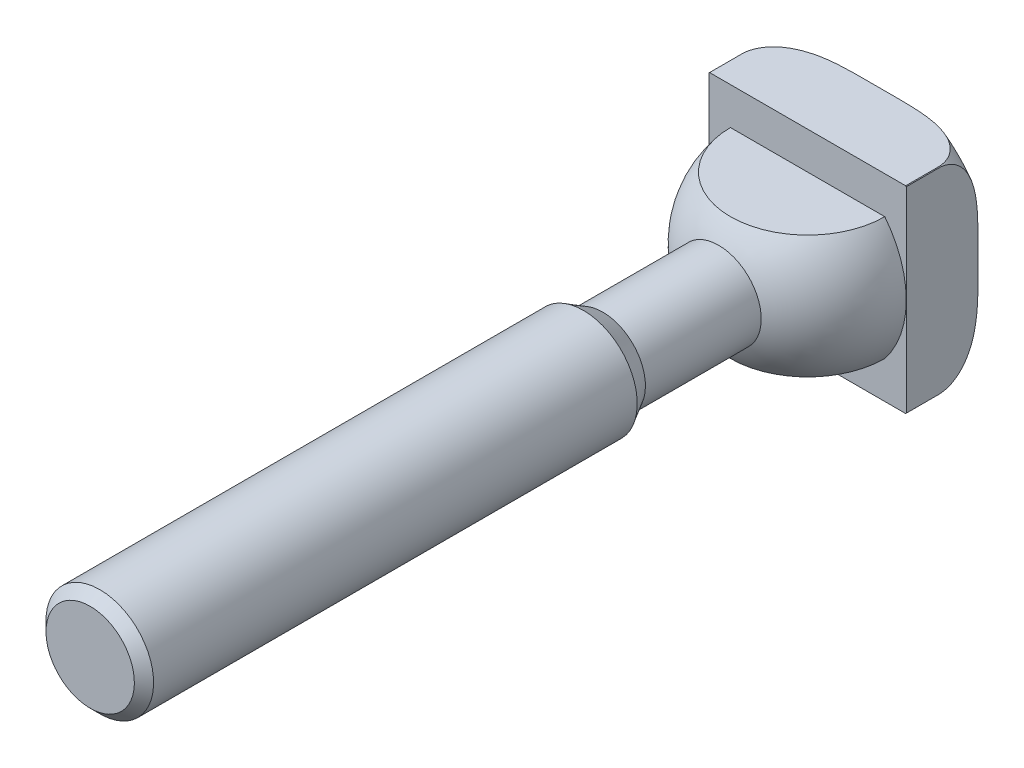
ISO-10303-21;
HEADER;
FILE_DESCRIPTION(('STEP AP214'),'2;1');
FILE_NAME('part.step','',(''),(''),'','','');
FILE_SCHEMA(('AUTOMOTIVE_DESIGN { 1 0 10303 214 1 1 1 1 }'));
ENDSEC;
DATA;
#1=APPLICATION_CONTEXT('core data for automotive mechanical design processes');
#2=APPLICATION_PROTOCOL_DEFINITION('international standard','automotive_design',2000,#1);
#3=PRODUCT_CONTEXT('',#1,'mechanical');
#4=PRODUCT('Part','Part','',(#3));
#5=PRODUCT_RELATED_PRODUCT_CATEGORY('part','',(#4));
#6=PRODUCT_DEFINITION_FORMATION('','',#4);
#7=PRODUCT_DEFINITION_CONTEXT('part definition',#1,'design');
#8=PRODUCT_DEFINITION('design','',#6,#7);
#9=PRODUCT_DEFINITION_SHAPE('','',#8);
#10=(LENGTH_UNIT() NAMED_UNIT(*) SI_UNIT(.MILLI.,.METRE.));
#11=(NAMED_UNIT(*) PLANE_ANGLE_UNIT() SI_UNIT($,.RADIAN.));
#12=(NAMED_UNIT(*) SI_UNIT($,.STERADIAN.) SOLID_ANGLE_UNIT());
#13=UNCERTAINTY_MEASURE_WITH_UNIT(LENGTH_MEASURE(1.E-05),#10,'distance_accuracy_value','');
#14=(GEOMETRIC_REPRESENTATION_CONTEXT(3) GLOBAL_UNCERTAINTY_ASSIGNED_CONTEXT((#13)) GLOBAL_UNIT_ASSIGNED_CONTEXT((#10,
#11,#12)) REPRESENTATION_CONTEXT('',''));
#15=CARTESIAN_POINT('',(0.,0.,0.));
#16=DIRECTION('',(0.,0.,1.));
#17=DIRECTION('',(1.,0.,0.));
#18=AXIS2_PLACEMENT_3D('',#15,#16,#17);
#19=CARTESIAN_POINT('',(0.,0.,-3.6));
#20=DIRECTION('',(0.,0.,1.));
#21=DIRECTION('',(0.,1.,0.));
#22=AXIS2_PLACEMENT_3D('',#19,#20,#21);
#23=TOROIDAL_SURFACE('',#22,11.11,4.4);
#24=CARTESIAN_POINT('',(-11.,0.,-7.9986247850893));
#25=CARTESIAN_POINT('',(-11.,-0.244167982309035,-7.99862566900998));
#26=CARTESIAN_POINT('',(-11.,-0.488335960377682,-7.99885116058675));
#27=CARTESIAN_POINT('',(-11.,-0.976671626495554,-7.99948190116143));
#28=CARTESIAN_POINT('',(-11.,-1.22083931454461,-7.99988715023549));
#29=CARTESIAN_POINT('',(-11.,-1.70936602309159,-8.00007526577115));
#30=CARTESIAN_POINT('',(-11.,-1.95372504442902,-7.99985764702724));
#31=CARTESIAN_POINT('',(-11.,-2.44244295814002,-7.99751713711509));
#32=CARTESIAN_POINT('',(-11.,-2.6868018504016,-7.99539420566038));
#33=CARTESIAN_POINT('',(-11.,-3.17540494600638,-7.98754889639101));
#34=CARTESIAN_POINT('',(-11.,-3.41964916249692,-7.98182749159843));
#35=CARTESIAN_POINT('',(-11.,-3.90794771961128,-7.96474581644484));
#36=CARTESIAN_POINT('',(-11.,-4.15200206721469,-7.95338576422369));
#37=CARTESIAN_POINT('',(-11.,-4.63930745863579,-7.92271306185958));
#38=CARTESIAN_POINT('',(-11.,-4.88255914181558,-7.9034111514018));
#39=CARTESIAN_POINT('',(-11.,-5.36808047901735,-7.85426911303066));
#40=CARTESIAN_POINT('',(-11.,-5.61034994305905,-7.82442703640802));
#41=CARTESIAN_POINT('',(-11.,-6.09743926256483,-7.75070651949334));
#42=CARTESIAN_POINT('',(-11.,-6.34222210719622,-7.70657606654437));
#43=CARTESIAN_POINT('',(-11.,-6.82803907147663,-7.60128676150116));
#44=CARTESIAN_POINT('',(-11.,-7.06907525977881,-7.54013768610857));
#45=CARTESIAN_POINT('',(-11.,-7.544028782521,-7.39777029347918));
#46=CARTESIAN_POINT('',(-11.,-7.7779742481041,-7.31664763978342));
#47=CARTESIAN_POINT('',(-11.,-8.23621103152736,-7.13090753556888));
#48=CARTESIAN_POINT('',(-11.,-8.46051347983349,-7.02631808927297));
#49=CARTESIAN_POINT('',(-11.,-8.8893021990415,-6.79347114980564));
#50=CARTESIAN_POINT('',(-11.,-9.09414705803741,-6.66588219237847));
#51=CARTESIAN_POINT('',(-11.,-9.48435680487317,-6.38282448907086));
#52=CARTESIAN_POINT('',(-11.,-9.66970590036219,-6.22733341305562));
#53=CARTESIAN_POINT('',(-11.,-9.92764272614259,-5.97197598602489));
#54=CARTESIAN_POINT('',(-11.,-10.0107063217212,-5.88257142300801));
#55=CARTESIAN_POINT('',(-11.,-10.1684678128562,-5.69669341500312));
#56=CARTESIAN_POINT('',(-11.,-10.2431702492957,-5.6002238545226));
#57=CARTESIAN_POINT('',(-11.,-10.3828802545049,-5.400676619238));
#58=CARTESIAN_POINT('',(-11.,-10.4479014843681,-5.29760855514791));
#59=CARTESIAN_POINT('',(-11.,-10.5670841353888,-5.08542919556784));
#60=CARTESIAN_POINT('',(-11.,-10.6212496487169,-4.97632019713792));
#61=CARTESIAN_POINT('',(-11.,-10.7405401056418,-4.69947224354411));
#62=CARTESIAN_POINT('',(-11.,-10.7985709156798,-4.52858953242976));
#63=CARTESIAN_POINT('',(-11.,-10.8850617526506,-4.17956065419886));
#64=CARTESIAN_POINT('',(-11.,-10.9135367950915,-4.00141822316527));
#65=CARTESIAN_POINT('',(-11.,-10.9392736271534,-3.64253555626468));
#66=CARTESIAN_POINT('',(-11.,-10.9364796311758,-3.46179125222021));
#67=CARTESIAN_POINT('',(-11.,-10.8997077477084,-3.10351565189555));
#68=CARTESIAN_POINT('',(-11.,-10.8657258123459,-2.92598477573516));
#69=CARTESIAN_POINT('',(-11.,-10.7697974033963,-2.58326250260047));
#70=CARTESIAN_POINT('',(-11.,-10.7085296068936,-2.41787879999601));
#71=CARTESIAN_POINT('',(-11.,-10.5614224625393,-2.09852829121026));
#72=CARTESIAN_POINT('',(-11.,-10.4755802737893,-1.94456280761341));
#73=CARTESIAN_POINT('',(-11.,-10.2740206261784,-1.6365408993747));
#74=CARTESIAN_POINT('',(-11.,-10.1562554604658,-1.48383203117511));
#75=CARTESIAN_POINT('',(-11.,-9.90072963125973,-1.19621722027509));
#76=CARTESIAN_POINT('',(-11.,-9.76295152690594,-1.06132700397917));
#77=CARTESIAN_POINT('',(-11.,-9.38652000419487,-0.735758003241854));
#78=CARTESIAN_POINT('',(-11.,-9.13606286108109,-0.558702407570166));
#79=CARTESIAN_POINT('',(-11.,-8.61050942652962,-0.246656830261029));
#80=CARTESIAN_POINT('',(-11.,-8.33537675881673,-0.111730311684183));
#81=CARTESIAN_POINT('',(-11.,-7.82006748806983,0.101266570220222));
#82=CARTESIAN_POINT('',(-11.,-7.58222898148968,0.185159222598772));
#83=CARTESIAN_POINT('',(-11.,-7.10003595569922,0.331865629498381));
#84=CARTESIAN_POINT('',(-11.,-6.85567647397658,0.394662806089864));
#85=CARTESIAN_POINT('',(-11.,-6.36219645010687,0.502824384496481));
#86=CARTESIAN_POINT('',(-11.,-6.1130607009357,0.548117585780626));
#87=CARTESIAN_POINT('',(-11.,-5.61276963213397,0.624275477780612));
#88=CARTESIAN_POINT('',(-11.,-5.3616152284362,0.655146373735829));
#89=CARTESIAN_POINT('',(-11.,-4.78187506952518,0.713294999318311));
#90=CARTESIAN_POINT('',(-11.,-4.45290899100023,0.736642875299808));
#91=CARTESIAN_POINT('',(-11.,-3.79428225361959,0.770498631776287));
#92=CARTESIAN_POINT('',(-11.,-3.46462137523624,0.781001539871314));
#93=CARTESIAN_POINT('',(-11.,-2.80475297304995,0.794523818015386));
#94=CARTESIAN_POINT('',(-11.,-2.47454529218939,0.797533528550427));
#95=CARTESIAN_POINT('',(-11.,-1.81418154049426,0.800324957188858));
#96=CARTESIAN_POINT('',(-11.,-1.48402546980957,0.800107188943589));
#97=CARTESIAN_POINT('',(-11.,-0.823934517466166,0.799332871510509));
#98=CARTESIAN_POINT('',(-11.,-0.493999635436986,0.798776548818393));
#99=CARTESIAN_POINT('',(-11.,0.165885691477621,0.798533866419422));
#100=CARTESIAN_POINT('',(-11.,0.495836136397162,0.798847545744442));
#101=CARTESIAN_POINT('',(-11.,1.15553605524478,0.799731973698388));
#102=CARTESIAN_POINT('',(-11.,1.48528553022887,0.800302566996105));
#103=CARTESIAN_POINT('',(-11.,2.14477656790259,0.799356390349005));
#104=CARTESIAN_POINT('',(-11.,2.47451813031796,0.797839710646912));
#105=CARTESIAN_POINT('',(-11.,3.04438053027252,0.790080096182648));
#106=CARTESIAN_POINT('',(-11.,3.28451680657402,0.785232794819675));
#107=CARTESIAN_POINT('',(-11.,3.76466882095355,0.770480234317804));
#108=CARTESIAN_POINT('',(-11.,4.00468454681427,0.760574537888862));
#109=CARTESIAN_POINT('',(-11.,4.48464487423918,0.733525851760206));
#110=CARTESIAN_POINT('',(-11.,4.72458897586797,0.716373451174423));
#111=CARTESIAN_POINT('',(-11.,5.20361397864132,0.672406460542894));
#112=CARTESIAN_POINT('',(-11.,5.44269491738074,0.645592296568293));
#113=CARTESIAN_POINT('',(-11.,5.92237388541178,0.579216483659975));
#114=CARTESIAN_POINT('',(-11.,6.1629497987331,0.539490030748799));
#115=CARTESIAN_POINT('',(-11.,6.64113749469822,0.444417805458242));
#116=CARTESIAN_POINT('',(-11.,6.87874845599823,0.38906780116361));
#117=CARTESIAN_POINT('',(-11.,7.34813652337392,0.259819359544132));
#118=CARTESIAN_POINT('',(-11.,7.57993016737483,0.185982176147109));
#119=CARTESIAN_POINT('',(-11.,8.03538420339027,0.0165125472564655));
#120=CARTESIAN_POINT('',(-11.,8.2590498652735,-0.0791054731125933));
#121=CARTESIAN_POINT('',(-11.,8.70040739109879,-0.298322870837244));
#122=CARTESIAN_POINT('',(-11.,8.91774655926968,-0.422642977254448));
#123=CARTESIAN_POINT('',(-11.,9.33339082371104,-0.700649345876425));
#124=CARTESIAN_POINT('',(-11.,9.53169018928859,-0.85434440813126));
#125=CARTESIAN_POINT('',(-11.,9.80930539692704,-1.10870064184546));
#126=CARTESIAN_POINT('',(-11.,9.89904640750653,-1.19810417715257));
#127=CARTESIAN_POINT('',(-11.,10.0700814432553,-1.38462017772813));
#128=CARTESIAN_POINT('',(-11.,10.1513803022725,-1.48172817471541));
#129=CARTESIAN_POINT('',(-11.,10.3040772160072,-1.6832606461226));
#130=CARTESIAN_POINT('',(-11.,10.3754890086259,-1.78767465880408));
#131=CARTESIAN_POINT('',(-11.,10.5070935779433,-2.00328733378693));
#132=CARTESIAN_POINT('',(-11.,10.5672911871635,-2.11448304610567));
#133=CARTESIAN_POINT('',(-11.,10.6985537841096,-2.39251409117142));
#134=CARTESIAN_POINT('',(-11.,10.7629998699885,-2.56255583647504));
#135=CARTESIAN_POINT('',(-11.,10.862440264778,-2.91098018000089));
#136=CARTESIAN_POINT('',(-11.,10.8974518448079,-3.08935782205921));
#137=CARTESIAN_POINT('',(-11.,10.9360122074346,-3.44995476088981));
#138=CARTESIAN_POINT('',(-11.,10.939487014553,-3.63218208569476));
#139=CARTESIAN_POINT('',(-11.,10.9145419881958,-3.99443117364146));
#140=CARTESIAN_POINT('',(-11.,10.8861197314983,-4.17445276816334));
#141=CARTESIAN_POINT('',(-11.,10.8006529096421,-4.52098257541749));
#142=CARTESIAN_POINT('',(-11.,10.7446134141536,-4.68774209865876));
#143=CARTESIAN_POINT('',(-11.,10.6074145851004,-5.01050120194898));
#144=CARTESIAN_POINT('',(-11.,10.5262513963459,-5.16649912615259));
#145=CARTESIAN_POINT('',(-11.,10.3348573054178,-5.47752748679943));
#146=CARTESIAN_POINT('',(-11.,10.2227798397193,-5.63141482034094));
#147=CARTESIAN_POINT('',(-11.,9.97826988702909,-5.92196783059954));
#148=CARTESIAN_POINT('',(-11.,9.84582459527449,-6.05862257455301));
#149=CARTESIAN_POINT('',(-11.,9.48633467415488,-6.38591323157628));
#150=CARTESIAN_POINT('',(-11.,9.24782164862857,-6.56397460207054));
#151=CARTESIAN_POINT('',(-11.,8.74555737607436,-6.87988293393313));
#152=CARTESIAN_POINT('',(-11.,8.48175205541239,-7.01764106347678));
#153=CARTESIAN_POINT('',(-11.,7.99126740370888,-7.23459728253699));
#154=CARTESIAN_POINT('',(-11.,7.76724215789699,-7.31996551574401));
#155=CARTESIAN_POINT('',(-11.,7.31248611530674,-7.47076953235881));
#156=CARTESIAN_POINT('',(-11.,7.08175056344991,-7.5361907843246));
#157=CARTESIAN_POINT('',(-11.,6.61580785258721,-7.6501637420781));
#158=CARTESIAN_POINT('',(-11.,6.38059348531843,-7.69868530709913));
#159=CARTESIAN_POINT('',(-11.,5.90765678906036,-7.78166493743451));
#160=CARTESIAN_POINT('',(-11.,5.6699334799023,-7.81611728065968));
#161=CARTESIAN_POINT('',(-11.,5.20678918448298,-7.87205097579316));
#162=CARTESIAN_POINT('',(-11.,4.98144154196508,-7.89416108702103));
#163=CARTESIAN_POINT('',(-11.,4.53016547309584,-7.93045973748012));
#164=CARTESIAN_POINT('',(-11.,4.30423713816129,-7.94464945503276));
#165=CARTESIAN_POINT('',(-11.,3.85190033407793,-7.96709033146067));
#166=CARTESIAN_POINT('',(-11.,3.62549161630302,-7.97533617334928));
#167=CARTESIAN_POINT('',(-11.,3.17256308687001,-7.98764124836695));
#168=CARTESIAN_POINT('',(-11.,2.94604327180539,-7.99170034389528));
#169=CARTESIAN_POINT('',(-11.,2.49282649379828,-7.99717570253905));
#170=CARTESIAN_POINT('',(-11.,2.26612951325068,-7.99859020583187));
#171=CARTESIAN_POINT('',(-11.,1.81273701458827,-8.00004599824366));
#172=CARTESIAN_POINT('',(-11.,1.58604149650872,-8.00008730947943));
#173=CARTESIAN_POINT('',(-11.,1.13278850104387,-7.99975527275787));
#174=CARTESIAN_POINT('',(-11.,0.906231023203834,-7.99938217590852));
#175=CARTESIAN_POINT('',(-11.,0.453115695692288,-7.99881652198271));
#176=CARTESIAN_POINT('',(-11.,0.226557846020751,-7.99862396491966));
#177=CARTESIAN_POINT('',(-11.,0.,-7.9986247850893));
#178=B_SPLINE_CURVE_WITH_KNOTS('',3,(#24,#25,#26,#27,#28,#29,#30,#31,#32,#33,#34,#35,#36,#37,
#38,#39,#40,#41,#42,#43,#44,#45,#46,#47,#48,#49,#50,#51,#52,#53,#54,#55,#56,#57,#58,#59,#60,#61,
#62,#63,#64,#65,#66,#67,#68,#69,#70,#71,#72,#73,#74,#75,#76,#77,#78,#79,#80,#81,#82,#83,#84,#85,
#86,#87,#88,#89,#90,#91,#92,#93,#94,#95,#96,#97,#98,#99,#100,#101,#102,#103,#104,#105,#106,#107,
#108,#109,#110,#111,#112,#113,#114,#115,#116,#117,#118,#119,#120,#121,#122,#123,#124,#125,#126,
#127,#128,#129,#130,#131,#132,#133,#134,#135,#136,#137,#138,#139,#140,#141,#142,#143,#144,#145,
#146,#147,#148,#149,#150,#151,#152,#153,#154,#155,#156,#157,#158,#159,#160,#161,#162,#163,#164,
#165,#166,#167,#168,#169,#170,#171,#172,#173,#174,#175,#176,#177),.UNSPECIFIED.,.T.,.F.,(4,2,2,
2,2,2,2,2,2,2,2,2,2,2,2,2,2,2,2,2,2,2,2,2,2,2,2,2,2,2,2,2,2,2,2,2,2,2,2,2,2,2,2,2,2,2,2,2,2,2,2,
2,2,2,2,2,2,2,2,2,2,2,2,2,2,2,2,2,2,2,2,2,2,2,2,2,4),(0.,0.732503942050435,1.46500819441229,
2.19808321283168,2.93117373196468,3.66406610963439,4.39693013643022,5.12880635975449,
5.86081796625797,6.60651638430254,7.3517873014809,8.09355590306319,8.83444397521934,
9.55651629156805,10.2791690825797,10.6448684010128,11.010368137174,11.3753471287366,
11.74018827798,12.2790367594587,12.8176113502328,13.3571469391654,13.8967525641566,
14.4236273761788,14.9505631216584,15.5269516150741,16.1038454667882,17.0187682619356,
17.9350627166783,18.6905663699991,19.4466623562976,20.2058023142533,20.9646153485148,
21.9535833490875,22.9429340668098,23.9335595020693,24.9240272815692,25.9138331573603,
26.9036834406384,27.892936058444,28.8821459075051,29.6026681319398,30.3232526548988,
31.0447758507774,31.7662672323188,32.4973547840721,33.2286405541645,33.9575346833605,
34.6859474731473,35.4351499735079,36.1845772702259,36.5641726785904,36.9435495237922,
37.3223938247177,37.7010744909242,38.2440729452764,38.7867525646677,39.3307048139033,
39.8746983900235,40.4002130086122,40.9258083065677,41.4947952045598,42.0641412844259,
42.9520282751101,43.8418577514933,44.5600475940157,45.2787593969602,45.9987465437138,
46.7190262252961,47.3981425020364,48.0771577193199,48.7567795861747,49.436423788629,
50.1165200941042,50.7966054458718,51.4762789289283,52.1559524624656),.UNSPECIFIED.);
#179=CARTESIAN_POINT('',(-11.,-1.55951915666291,-8.));
#180=VERTEX_POINT('',#179);
#181=CARTESIAN_POINT('',(-11.,-10.9343541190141,-3.6));
#182=VERTEX_POINT('',#181);
#183=EDGE_CURVE('E216',#180,#182,#178,.T.);
#184=ORIENTED_EDGE('',*,*,#183,.F.);
#185=CARTESIAN_POINT('',(0.,0.,-8.));
#186=DIRECTION('',(0.,0.,1.));
#187=DIRECTION('',(0.,1.,0.));
#188=AXIS2_PLACEMENT_3D('',#185,#186,#187);
#189=CIRCLE('',#188,11.11);
#190=CARTESIAN_POINT('',(-1.55951915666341,-11.,-8.));
#191=VERTEX_POINT('',#190);
#192=EDGE_CURVE('E291',#180,#191,#189,.T.);
#193=ORIENTED_EDGE('',*,*,#192,.T.);
#194=CARTESIAN_POINT('',(0.,-11.,-7.9986247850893));
#195=CARTESIAN_POINT('',(0.244167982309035,-11.,-7.99862566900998));
#196=CARTESIAN_POINT('',(0.488335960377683,-11.,-7.99885116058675));
#197=CARTESIAN_POINT('',(0.976671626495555,-11.,-7.99948190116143));
#198=CARTESIAN_POINT('',(1.22083931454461,-11.,-7.99988715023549));
#199=CARTESIAN_POINT('',(1.70936602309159,-11.,-8.00007526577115));
#200=CARTESIAN_POINT('',(1.95372504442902,-11.,-7.99985764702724));
#201=CARTESIAN_POINT('',(2.44244295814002,-11.,-7.99751713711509));
#202=CARTESIAN_POINT('',(2.68680185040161,-11.,-7.99539420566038));
#203=CARTESIAN_POINT('',(3.17540494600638,-11.,-7.98754889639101));
#204=CARTESIAN_POINT('',(3.41964916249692,-11.,-7.98182749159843));
#205=CARTESIAN_POINT('',(3.90794771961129,-11.,-7.96474581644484));
#206=CARTESIAN_POINT('',(4.15200206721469,-11.,-7.95338576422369));
#207=CARTESIAN_POINT('',(4.63930745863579,-11.,-7.92271306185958));
#208=CARTESIAN_POINT('',(4.88255914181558,-11.,-7.90341115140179));
#209=CARTESIAN_POINT('',(5.36808047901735,-11.,-7.85426911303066));
#210=CARTESIAN_POINT('',(5.61034994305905,-11.,-7.82442703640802));
#211=CARTESIAN_POINT('',(6.09743926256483,-11.,-7.75070651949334));
#212=CARTESIAN_POINT('',(6.34222210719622,-11.,-7.70657606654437));
#213=CARTESIAN_POINT('',(6.82803907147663,-11.,-7.60128676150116));
#214=CARTESIAN_POINT('',(7.06907525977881,-11.,-7.54013768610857));
#215=CARTESIAN_POINT('',(7.54402878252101,-11.,-7.39777029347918));
#216=CARTESIAN_POINT('',(7.7779742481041,-11.,-7.31664763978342));
#217=CARTESIAN_POINT('',(8.23621103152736,-11.,-7.13090753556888));
#218=CARTESIAN_POINT('',(8.46051347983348,-11.,-7.02631808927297));
#219=CARTESIAN_POINT('',(8.8893021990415,-11.,-6.79347114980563));
#220=CARTESIAN_POINT('',(9.09414705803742,-11.,-6.66588219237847));
#221=CARTESIAN_POINT('',(9.48435680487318,-11.,-6.38282448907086));
#222=CARTESIAN_POINT('',(9.66970590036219,-11.,-6.22733341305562));
#223=CARTESIAN_POINT('',(9.92764272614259,-11.,-5.97197598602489));
#224=CARTESIAN_POINT('',(10.0107063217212,-11.,-5.88257142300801));
#225=CARTESIAN_POINT('',(10.1684678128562,-11.,-5.69669341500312));
#226=CARTESIAN_POINT('',(10.2431702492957,-11.,-5.6002238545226));
#227=CARTESIAN_POINT('',(10.3828802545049,-11.,-5.400676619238));
#228=CARTESIAN_POINT('',(10.4479014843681,-11.,-5.29760855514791));
#229=CARTESIAN_POINT('',(10.5670841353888,-11.,-5.08542919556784));
#230=CARTESIAN_POINT('',(10.6212496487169,-11.,-4.97632019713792));
#231=CARTESIAN_POINT('',(10.7405401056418,-11.,-4.69947224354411));
#232=CARTESIAN_POINT('',(10.7985709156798,-11.,-4.52858953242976));
#233=CARTESIAN_POINT('',(10.8850617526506,-11.,-4.17956065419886));
#234=CARTESIAN_POINT('',(10.9135367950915,-11.,-4.00141822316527));
#235=CARTESIAN_POINT('',(10.9392736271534,-11.,-3.64253555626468));
#236=CARTESIAN_POINT('',(10.9364796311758,-11.,-3.46179125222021));
#237=CARTESIAN_POINT('',(10.8997077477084,-11.,-3.10351565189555));
#238=CARTESIAN_POINT('',(10.8657258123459,-11.,-2.92598477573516));
#239=CARTESIAN_POINT('',(10.7697974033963,-11.,-2.58326250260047));
#240=CARTESIAN_POINT('',(10.7085296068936,-11.,-2.41787879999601));
#241=CARTESIAN_POINT('',(10.5614224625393,-11.,-2.09852829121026));
#242=CARTESIAN_POINT('',(10.4755802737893,-11.,-1.94456280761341));
#243=CARTESIAN_POINT('',(10.2740206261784,-11.,-1.6365408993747));
#244=CARTESIAN_POINT('',(10.1562554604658,-11.,-1.4838320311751));
#245=CARTESIAN_POINT('',(9.90072963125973,-11.,-1.19621722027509));
#246=CARTESIAN_POINT('',(9.76295152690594,-11.,-1.06132700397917));
#247=CARTESIAN_POINT('',(9.38652000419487,-11.,-0.735758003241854));
#248=CARTESIAN_POINT('',(9.13606286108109,-11.,-0.558702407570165));
#249=CARTESIAN_POINT('',(8.61050942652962,-11.,-0.246656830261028));
#250=CARTESIAN_POINT('',(8.33537675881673,-11.,-0.111730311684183));
#251=CARTESIAN_POINT('',(7.82006748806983,-11.,0.101266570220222));
#252=CARTESIAN_POINT('',(7.58222898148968,-11.,0.185159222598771));
#253=CARTESIAN_POINT('',(7.10003595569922,-11.,0.33186562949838));
#254=CARTESIAN_POINT('',(6.85567647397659,-11.,0.394662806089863));
#255=CARTESIAN_POINT('',(6.36219645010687,-11.,0.50282438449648));
#256=CARTESIAN_POINT('',(6.11306070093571,-11.,0.548117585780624));
#257=CARTESIAN_POINT('',(5.61276963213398,-11.,0.62427547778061));
#258=CARTESIAN_POINT('',(5.36161522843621,-11.,0.655146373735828));
#259=CARTESIAN_POINT('',(4.78187506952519,-11.,0.713294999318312));
#260=CARTESIAN_POINT('',(4.45290899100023,-11.,0.736642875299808));
#261=CARTESIAN_POINT('',(3.79428225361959,-11.,0.770498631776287));
#262=CARTESIAN_POINT('',(3.46462137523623,-11.,0.781001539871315));
#263=CARTESIAN_POINT('',(2.80475297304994,-11.,0.794523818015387));
#264=CARTESIAN_POINT('',(2.47454529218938,-11.,0.797533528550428));
#265=CARTESIAN_POINT('',(1.81418154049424,-11.,0.800324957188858));
#266=CARTESIAN_POINT('',(1.48402546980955,-11.,0.800107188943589));
#267=CARTESIAN_POINT('',(0.823934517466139,-11.,0.799332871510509));
#268=CARTESIAN_POINT('',(0.493999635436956,-11.,0.798776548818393));
#269=CARTESIAN_POINT('',(-0.165885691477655,-11.,0.798533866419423));
#270=CARTESIAN_POINT('',(-0.495836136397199,-11.,0.798847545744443));
#271=CARTESIAN_POINT('',(-1.15553605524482,-11.,0.799731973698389));
#272=CARTESIAN_POINT('',(-1.48528553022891,-11.,0.800302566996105));
#273=CARTESIAN_POINT('',(-2.14477656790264,-11.,0.799356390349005));
#274=CARTESIAN_POINT('',(-2.47451813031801,-11.,0.797839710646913));
#275=CARTESIAN_POINT('',(-3.04438053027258,-11.,0.790080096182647));
#276=CARTESIAN_POINT('',(-3.28451680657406,-11.,0.785232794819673));
#277=CARTESIAN_POINT('',(-3.76466882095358,-11.,0.770480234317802));
#278=CARTESIAN_POINT('',(-4.00468454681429,-11.,0.760574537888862));
#279=CARTESIAN_POINT('',(-4.48464487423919,-11.,0.733525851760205));
#280=CARTESIAN_POINT('',(-4.72458897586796,-11.,0.716373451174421));
#281=CARTESIAN_POINT('',(-5.2036139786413,-11.,0.672406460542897));
#282=CARTESIAN_POINT('',(-5.44269491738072,-11.,0.645592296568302));
#283=CARTESIAN_POINT('',(-5.92237388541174,-11.,0.579216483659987));
#284=CARTESIAN_POINT('',(-6.16294979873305,-11.,0.539490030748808));
#285=CARTESIAN_POINT('',(-6.64113749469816,-11.,0.444417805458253));
#286=CARTESIAN_POINT('',(-6.87874845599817,-11.,0.389067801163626));
#287=CARTESIAN_POINT('',(-7.34813652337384,-11.,0.259819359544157));
#288=CARTESIAN_POINT('',(-7.57993016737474,-11.,0.185982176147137));
#289=CARTESIAN_POINT('',(-8.03538420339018,-11.,0.0165125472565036));
#290=CARTESIAN_POINT('',(-8.2590498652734,-11.,-0.0791054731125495));
#291=CARTESIAN_POINT('',(-8.70040739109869,-11.,-0.298322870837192));
#292=CARTESIAN_POINT('',(-8.91774655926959,-11.,-0.422642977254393));
#293=CARTESIAN_POINT('',(-9.33339082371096,-11.,-0.700649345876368));
#294=CARTESIAN_POINT('',(-9.53169018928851,-11.,-0.854344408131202));
#295=CARTESIAN_POINT('',(-9.80930539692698,-11.,-1.1087006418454));
#296=CARTESIAN_POINT('',(-9.89904640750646,-11.,-1.19810417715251));
#297=CARTESIAN_POINT('',(-10.0700814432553,-11.,-1.38462017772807));
#298=CARTESIAN_POINT('',(-10.1513803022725,-11.,-1.48172817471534));
#299=CARTESIAN_POINT('',(-10.3040772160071,-11.,-1.68326064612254));
#300=CARTESIAN_POINT('',(-10.3754890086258,-11.,-1.78767465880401));
#301=CARTESIAN_POINT('',(-10.5070935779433,-11.,-2.00328733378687));
#302=CARTESIAN_POINT('',(-10.5672911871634,-11.,-2.11448304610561));
#303=CARTESIAN_POINT('',(-10.6985537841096,-11.,-2.39251409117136));
#304=CARTESIAN_POINT('',(-10.7629998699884,-11.,-2.56255583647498));
#305=CARTESIAN_POINT('',(-10.8624402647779,-11.,-2.91098018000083));
#306=CARTESIAN_POINT('',(-10.8974518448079,-11.,-3.08935782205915));
#307=CARTESIAN_POINT('',(-10.9360122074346,-11.,-3.44995476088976));
#308=CARTESIAN_POINT('',(-10.939487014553,-11.,-3.63218208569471));
#309=CARTESIAN_POINT('',(-10.9145419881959,-11.,-3.99443117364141));
#310=CARTESIAN_POINT('',(-10.8861197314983,-11.,-4.17445276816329));
#311=CARTESIAN_POINT('',(-10.8006529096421,-11.,-4.52098257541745));
#312=CARTESIAN_POINT('',(-10.7446134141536,-11.,-4.68774209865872));
#313=CARTESIAN_POINT('',(-10.6074145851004,-11.,-5.01050120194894));
#314=CARTESIAN_POINT('',(-10.5262513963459,-11.,-5.16649912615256));
#315=CARTESIAN_POINT('',(-10.3348573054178,-11.,-5.47752748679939));
#316=CARTESIAN_POINT('',(-10.2227798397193,-11.,-5.63141482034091));
#317=CARTESIAN_POINT('',(-9.97826988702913,-11.,-5.92196783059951));
#318=CARTESIAN_POINT('',(-9.84582459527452,-11.,-6.05862257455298));
#319=CARTESIAN_POINT('',(-9.48633467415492,-11.,-6.38591323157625));
#320=CARTESIAN_POINT('',(-9.24782164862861,-11.,-6.56397460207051));
#321=CARTESIAN_POINT('',(-8.74555737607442,-11.,-6.8798829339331));
#322=CARTESIAN_POINT('',(-8.48175205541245,-11.,-7.01764106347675));
#323=CARTESIAN_POINT('',(-7.99126740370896,-11.,-7.23459728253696));
#324=CARTESIAN_POINT('',(-7.76724215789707,-11.,-7.31996551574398));
#325=CARTESIAN_POINT('',(-7.31248611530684,-11.,-7.47076953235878));
#326=CARTESIAN_POINT('',(-7.08175056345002,-11.,-7.53619078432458));
#327=CARTESIAN_POINT('',(-6.61580785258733,-11.,-7.65016374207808));
#328=CARTESIAN_POINT('',(-6.38059348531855,-11.,-7.6986853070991));
#329=CARTESIAN_POINT('',(-5.90765678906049,-11.,-7.78166493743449));
#330=CARTESIAN_POINT('',(-5.66993347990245,-11.,-7.81611728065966));
#331=CARTESIAN_POINT('',(-5.20678918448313,-11.,-7.87205097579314));
#332=CARTESIAN_POINT('',(-4.98144154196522,-11.,-7.89416108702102));
#333=CARTESIAN_POINT('',(-4.53016547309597,-11.,-7.93045973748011));
#334=CARTESIAN_POINT('',(-4.30423713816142,-11.,-7.94464945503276));
#335=CARTESIAN_POINT('',(-3.85190033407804,-11.,-7.96709033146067));
#336=CARTESIAN_POINT('',(-3.62549161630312,-11.,-7.97533617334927));
#337=CARTESIAN_POINT('',(-3.1725630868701,-11.,-7.98764124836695));
#338=CARTESIAN_POINT('',(-2.94604327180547,-11.,-7.99170034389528));
#339=CARTESIAN_POINT('',(-2.49282649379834,-11.,-7.99717570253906));
#340=CARTESIAN_POINT('',(-2.26612951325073,-11.,-7.99859020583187));
#341=CARTESIAN_POINT('',(-1.81273701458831,-11.,-8.00004599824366));
#342=CARTESIAN_POINT('',(-1.58604149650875,-11.,-8.00008730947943));
#343=CARTESIAN_POINT('',(-1.1327885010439,-11.,-7.99975527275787));
#344=CARTESIAN_POINT('',(-0.906231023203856,-11.,-7.99938217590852));
#345=CARTESIAN_POINT('',(-0.453115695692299,-11.,-7.99881652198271));
#346=CARTESIAN_POINT('',(-0.226557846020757,-11.,-7.99862396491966));
#347=CARTESIAN_POINT('',(0.,-11.,-7.9986247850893));
#348=B_SPLINE_CURVE_WITH_KNOTS('',3,(#194,#195,#196,#197,#198,#199,#200,#201,#202,#203,#204,
#205,#206,#207,#208,#209,#210,#211,#212,#213,#214,#215,#216,#217,#218,#219,#220,#221,#222,#223,
#224,#225,#226,#227,#228,#229,#230,#231,#232,#233,#234,#235,#236,#237,#238,#239,#240,#241,#242,
#243,#244,#245,#246,#247,#248,#249,#250,#251,#252,#253,#254,#255,#256,#257,#258,#259,#260,#261,
#262,#263,#264,#265,#266,#267,#268,#269,#270,#271,#272,#273,#274,#275,#276,#277,#278,#279,#280,
#281,#282,#283,#284,#285,#286,#287,#288,#289,#290,#291,#292,#293,#294,#295,#296,#297,#298,#299,
#300,#301,#302,#303,#304,#305,#306,#307,#308,#309,#310,#311,#312,#313,#314,#315,#316,#317,#318,
#319,#320,#321,#322,#323,#324,#325,#326,#327,#328,#329,#330,#331,#332,#333,#334,#335,#336,#337,
#338,#339,#340,#341,#342,#343,#344,#345,#346,#347),.UNSPECIFIED.,.T.,.F.,(4,2,2,2,2,2,2,2,2,2,2,
2,2,2,2,2,2,2,2,2,2,2,2,2,2,2,2,2,2,2,2,2,2,2,2,2,2,2,2,2,2,2,2,2,2,2,2,2,2,2,2,2,2,2,2,2,2,2,2,
2,2,2,2,2,2,2,2,2,2,2,2,2,2,2,2,2,4),(0.,0.732503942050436,1.46500819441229,2.19808321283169,
2.93117373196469,3.66406610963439,4.39693013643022,5.12880635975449,5.86081796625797,
6.60651638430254,7.35178730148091,8.09355590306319,8.83444397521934,9.55651629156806,
10.2791690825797,10.6448684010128,11.010368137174,11.3753471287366,11.74018827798,
12.2790367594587,12.8176113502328,13.3571469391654,13.8967525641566,14.4236273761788,
14.9505631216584,15.5269516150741,16.1038454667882,17.0187682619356,17.9350627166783,
18.6905663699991,19.4466623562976,20.2058023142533,20.9646153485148,21.9535833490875,
22.9429340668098,23.9335595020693,24.9240272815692,25.9138331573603,26.9036834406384,
27.892936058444,28.8821459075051,29.6026681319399,30.3232526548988,31.0447758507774,
31.7662672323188,32.4973547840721,33.2286405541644,33.9575346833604,34.6859474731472,
35.4351499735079,36.1845772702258,36.5641726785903,36.9435495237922,37.3223938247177,
37.7010744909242,38.2440729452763,38.7867525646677,39.3307048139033,39.8746983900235,
40.4002130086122,40.9258083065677,41.4947952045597,42.0641412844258,42.95202827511,
43.8418577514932,44.5600475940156,45.2787593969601,45.9987465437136,46.7190262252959,
47.3981425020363,48.0771577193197,48.7567795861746,49.4364237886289,50.1165200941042,
50.7966054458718,51.4762789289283,52.1559524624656),.UNSPECIFIED.);
#349=CARTESIAN_POINT('',(-10.9343541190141,-11.,-3.6));
#350=VERTEX_POINT('',#349);
#351=EDGE_CURVE('E177',#350,#191,#348,.T.);
#352=ORIENTED_EDGE('',*,*,#351,.F.);
#353=CARTESIAN_POINT('',(0.,0.,-3.6));
#354=DIRECTION('',(0.,0.,1.));
#355=DIRECTION('',(0.,1.,0.));
#356=AXIS2_PLACEMENT_3D('',#353,#354,#355);
#357=CIRCLE('',#356,15.51);
#358=EDGE_CURVE('E174',#182,#350,#357,.T.);
#359=ORIENTED_EDGE('',*,*,#358,.F.);
#360=EDGE_LOOP('',(#184,#193,#352,#359));
#361=FACE_BOUND('',#360,.T.);
#362=ADVANCED_FACE('F14',(#361),#23,.T.);
#363=CARTESIAN_POINT('',(1.55951915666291,-11.,-8.));
#364=VERTEX_POINT('',#363);
#365=CARTESIAN_POINT('',(10.9343541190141,-11.,-3.6));
#366=VERTEX_POINT('',#365);
#367=EDGE_CURVE('E180',#364,#366,#348,.T.);
#368=ORIENTED_EDGE('',*,*,#367,.F.);
#369=CARTESIAN_POINT('',(11.,-1.5595191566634,-8.));
#370=VERTEX_POINT('',#369);
#371=EDGE_CURVE('E288',#364,#370,#189,.T.);
#372=ORIENTED_EDGE('',*,*,#371,.T.);
#373=CARTESIAN_POINT('',(11.,0.,-7.9986247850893));
#374=CARTESIAN_POINT('',(11.,0.244167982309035,-7.99862566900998));
#375=CARTESIAN_POINT('',(11.,0.488335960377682,-7.99885116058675));
#376=CARTESIAN_POINT('',(11.,0.976671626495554,-7.99948190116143));
#377=CARTESIAN_POINT('',(11.,1.22083931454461,-7.99988715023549));
#378=CARTESIAN_POINT('',(11.,1.70936602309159,-8.00007526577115));
#379=CARTESIAN_POINT('',(11.,1.95372504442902,-7.99985764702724));
#380=CARTESIAN_POINT('',(11.,2.44244295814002,-7.99751713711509));
#381=CARTESIAN_POINT('',(11.,2.6868018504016,-7.99539420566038));
#382=CARTESIAN_POINT('',(11.,3.17540494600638,-7.98754889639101));
#383=CARTESIAN_POINT('',(11.,3.41964916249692,-7.98182749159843));
#384=CARTESIAN_POINT('',(11.,3.90794771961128,-7.96474581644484));
#385=CARTESIAN_POINT('',(11.,4.15200206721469,-7.95338576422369));
#386=CARTESIAN_POINT('',(11.,4.63930745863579,-7.92271306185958));
#387=CARTESIAN_POINT('',(11.,4.88255914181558,-7.9034111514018));
#388=CARTESIAN_POINT('',(11.,5.36808047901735,-7.85426911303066));
#389=CARTESIAN_POINT('',(11.,5.61034994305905,-7.82442703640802));
#390=CARTESIAN_POINT('',(11.,6.09743926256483,-7.75070651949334));
#391=CARTESIAN_POINT('',(11.,6.34222210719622,-7.70657606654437));
#392=CARTESIAN_POINT('',(11.,6.82803907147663,-7.60128676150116));
#393=CARTESIAN_POINT('',(11.,7.06907525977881,-7.54013768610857));
#394=CARTESIAN_POINT('',(11.,7.544028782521,-7.39777029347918));
#395=CARTESIAN_POINT('',(11.,7.7779742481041,-7.31664763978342));
#396=CARTESIAN_POINT('',(11.,8.23621103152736,-7.13090753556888));
#397=CARTESIAN_POINT('',(11.,8.46051347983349,-7.02631808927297));
#398=CARTESIAN_POINT('',(11.,8.8893021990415,-6.79347114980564));
#399=CARTESIAN_POINT('',(11.,9.09414705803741,-6.66588219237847));
#400=CARTESIAN_POINT('',(11.,9.48435680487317,-6.38282448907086));
#401=CARTESIAN_POINT('',(11.,9.66970590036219,-6.22733341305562));
#402=CARTESIAN_POINT('',(11.,9.92764272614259,-5.97197598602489));
#403=CARTESIAN_POINT('',(11.,10.0107063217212,-5.88257142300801));
#404=CARTESIAN_POINT('',(11.,10.1684678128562,-5.69669341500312));
#405=CARTESIAN_POINT('',(11.,10.2431702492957,-5.6002238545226));
#406=CARTESIAN_POINT('',(11.,10.3828802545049,-5.400676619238));
#407=CARTESIAN_POINT('',(11.,10.4479014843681,-5.29760855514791));
#408=CARTESIAN_POINT('',(11.,10.5670841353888,-5.08542919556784));
#409=CARTESIAN_POINT('',(11.,10.6212496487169,-4.97632019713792));
#410=CARTESIAN_POINT('',(11.,10.7405401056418,-4.69947224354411));
#411=CARTESIAN_POINT('',(11.,10.7985709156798,-4.52858953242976));
#412=CARTESIAN_POINT('',(11.,10.8850617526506,-4.17956065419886));
#413=CARTESIAN_POINT('',(11.,10.9135367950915,-4.00141822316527));
#414=CARTESIAN_POINT('',(11.,10.9392736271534,-3.64253555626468));
#415=CARTESIAN_POINT('',(11.,10.9364796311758,-3.46179125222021));
#416=CARTESIAN_POINT('',(11.,10.8997077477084,-3.10351565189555));
#417=CARTESIAN_POINT('',(11.,10.8657258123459,-2.92598477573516));
#418=CARTESIAN_POINT('',(11.,10.7697974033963,-2.58326250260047));
#419=CARTESIAN_POINT('',(11.,10.7085296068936,-2.41787879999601));
#420=CARTESIAN_POINT('',(11.,10.5614224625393,-2.09852829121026));
#421=CARTESIAN_POINT('',(11.,10.4755802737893,-1.94456280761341));
#422=CARTESIAN_POINT('',(11.,10.2740206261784,-1.6365408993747));
#423=CARTESIAN_POINT('',(11.,10.1562554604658,-1.48383203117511));
#424=CARTESIAN_POINT('',(11.,9.90072963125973,-1.19621722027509));
#425=CARTESIAN_POINT('',(11.,9.76295152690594,-1.06132700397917));
#426=CARTESIAN_POINT('',(11.,9.38652000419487,-0.735758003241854));
#427=CARTESIAN_POINT('',(11.,9.13606286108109,-0.558702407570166));
#428=CARTESIAN_POINT('',(11.,8.61050942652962,-0.246656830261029));
#429=CARTESIAN_POINT('',(11.,8.33537675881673,-0.111730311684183));
#430=CARTESIAN_POINT('',(11.,7.82006748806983,0.101266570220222));
#431=CARTESIAN_POINT('',(11.,7.58222898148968,0.185159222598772));
#432=CARTESIAN_POINT('',(11.,7.10003595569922,0.331865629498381));
#433=CARTESIAN_POINT('',(11.,6.85567647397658,0.394662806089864));
#434=CARTESIAN_POINT('',(11.,6.36219645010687,0.502824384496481));
#435=CARTESIAN_POINT('',(11.,6.1130607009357,0.548117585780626));
#436=CARTESIAN_POINT('',(11.,5.61276963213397,0.624275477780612));
#437=CARTESIAN_POINT('',(11.,5.3616152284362,0.655146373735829));
#438=CARTESIAN_POINT('',(11.,4.78187506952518,0.713294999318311));
#439=CARTESIAN_POINT('',(11.,4.45290899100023,0.736642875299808));
#440=CARTESIAN_POINT('',(11.,3.79428225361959,0.770498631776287));
#441=CARTESIAN_POINT('',(11.,3.46462137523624,0.781001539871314));
#442=CARTESIAN_POINT('',(11.,2.80475297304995,0.794523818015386));
#443=CARTESIAN_POINT('',(11.,2.47454529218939,0.797533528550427));
#444=CARTESIAN_POINT('',(11.,1.81418154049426,0.800324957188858));
#445=CARTESIAN_POINT('',(11.,1.48402546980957,0.800107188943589));
#446=CARTESIAN_POINT('',(11.,0.823934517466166,0.799332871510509));
#447=CARTESIAN_POINT('',(11.,0.493999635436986,0.798776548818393));
#448=CARTESIAN_POINT('',(11.,-0.165885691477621,0.798533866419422));
#449=CARTESIAN_POINT('',(11.,-0.495836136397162,0.798847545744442));
#450=CARTESIAN_POINT('',(11.,-1.15553605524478,0.799731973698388));
#451=CARTESIAN_POINT('',(11.,-1.48528553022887,0.800302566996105));
#452=CARTESIAN_POINT('',(11.,-2.14477656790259,0.799356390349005));
#453=CARTESIAN_POINT('',(11.,-2.47451813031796,0.797839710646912));
#454=CARTESIAN_POINT('',(11.,-3.04438053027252,0.790080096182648));
#455=CARTESIAN_POINT('',(11.,-3.28451680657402,0.785232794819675));
#456=CARTESIAN_POINT('',(11.,-3.76466882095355,0.770480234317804));
#457=CARTESIAN_POINT('',(11.,-4.00468454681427,0.760574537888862));
#458=CARTESIAN_POINT('',(11.,-4.48464487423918,0.733525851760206));
#459=CARTESIAN_POINT('',(11.,-4.72458897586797,0.716373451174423));
#460=CARTESIAN_POINT('',(11.,-5.20361397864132,0.672406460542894));
#461=CARTESIAN_POINT('',(11.,-5.44269491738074,0.645592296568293));
#462=CARTESIAN_POINT('',(11.,-5.92237388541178,0.579216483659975));
#463=CARTESIAN_POINT('',(11.,-6.1629497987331,0.539490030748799));
#464=CARTESIAN_POINT('',(11.,-6.64113749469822,0.444417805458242));
#465=CARTESIAN_POINT('',(11.,-6.87874845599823,0.38906780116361));
#466=CARTESIAN_POINT('',(11.,-7.34813652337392,0.259819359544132));
#467=CARTESIAN_POINT('',(11.,-7.57993016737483,0.185982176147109));
#468=CARTESIAN_POINT('',(11.,-8.03538420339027,0.0165125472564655));
#469=CARTESIAN_POINT('',(11.,-8.2590498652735,-0.0791054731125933));
#470=CARTESIAN_POINT('',(11.,-8.70040739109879,-0.298322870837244));
#471=CARTESIAN_POINT('',(11.,-8.91774655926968,-0.422642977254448));
#472=CARTESIAN_POINT('',(11.,-9.33339082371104,-0.700649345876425));
#473=CARTESIAN_POINT('',(11.,-9.53169018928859,-0.85434440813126));
#474=CARTESIAN_POINT('',(11.,-9.80930539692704,-1.10870064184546));
#475=CARTESIAN_POINT('',(11.,-9.89904640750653,-1.19810417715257));
#476=CARTESIAN_POINT('',(11.,-10.0700814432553,-1.38462017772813));
#477=CARTESIAN_POINT('',(11.,-10.1513803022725,-1.48172817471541));
#478=CARTESIAN_POINT('',(11.,-10.3040772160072,-1.6832606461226));
#479=CARTESIAN_POINT('',(11.,-10.3754890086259,-1.78767465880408));
#480=CARTESIAN_POINT('',(11.,-10.5070935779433,-2.00328733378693));
#481=CARTESIAN_POINT('',(11.,-10.5672911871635,-2.11448304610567));
#482=CARTESIAN_POINT('',(11.,-10.6985537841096,-2.39251409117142));
#483=CARTESIAN_POINT('',(11.,-10.7629998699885,-2.56255583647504));
#484=CARTESIAN_POINT('',(11.,-10.862440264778,-2.91098018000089));
#485=CARTESIAN_POINT('',(11.,-10.8974518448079,-3.08935782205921));
#486=CARTESIAN_POINT('',(11.,-10.9360122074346,-3.44995476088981));
#487=CARTESIAN_POINT('',(11.,-10.939487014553,-3.63218208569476));
#488=CARTESIAN_POINT('',(11.,-10.9145419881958,-3.99443117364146));
#489=CARTESIAN_POINT('',(11.,-10.8861197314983,-4.17445276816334));
#490=CARTESIAN_POINT('',(11.,-10.8006529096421,-4.52098257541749));
#491=CARTESIAN_POINT('',(11.,-10.7446134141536,-4.68774209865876));
#492=CARTESIAN_POINT('',(11.,-10.6074145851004,-5.01050120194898));
#493=CARTESIAN_POINT('',(11.,-10.5262513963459,-5.16649912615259));
#494=CARTESIAN_POINT('',(11.,-10.3348573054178,-5.47752748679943));
#495=CARTESIAN_POINT('',(11.,-10.2227798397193,-5.63141482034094));
#496=CARTESIAN_POINT('',(11.,-9.97826988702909,-5.92196783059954));
#497=CARTESIAN_POINT('',(11.,-9.84582459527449,-6.05862257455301));
#498=CARTESIAN_POINT('',(11.,-9.48633467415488,-6.38591323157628));
#499=CARTESIAN_POINT('',(11.,-9.24782164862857,-6.56397460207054));
#500=CARTESIAN_POINT('',(11.,-8.74555737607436,-6.87988293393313));
#501=CARTESIAN_POINT('',(11.,-8.48175205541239,-7.01764106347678));
#502=CARTESIAN_POINT('',(11.,-7.99126740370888,-7.23459728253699));
#503=CARTESIAN_POINT('',(11.,-7.76724215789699,-7.31996551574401));
#504=CARTESIAN_POINT('',(11.,-7.31248611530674,-7.47076953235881));
#505=CARTESIAN_POINT('',(11.,-7.08175056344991,-7.5361907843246));
#506=CARTESIAN_POINT('',(11.,-6.61580785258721,-7.6501637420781));
#507=CARTESIAN_POINT('',(11.,-6.38059348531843,-7.69868530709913));
#508=CARTESIAN_POINT('',(11.,-5.90765678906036,-7.78166493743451));
#509=CARTESIAN_POINT('',(11.,-5.6699334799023,-7.81611728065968));
#510=CARTESIAN_POINT('',(11.,-5.20678918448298,-7.87205097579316));
#511=CARTESIAN_POINT('',(11.,-4.98144154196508,-7.89416108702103));
#512=CARTESIAN_POINT('',(11.,-4.53016547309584,-7.93045973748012));
#513=CARTESIAN_POINT('',(11.,-4.30423713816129,-7.94464945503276));
#514=CARTESIAN_POINT('',(11.,-3.85190033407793,-7.96709033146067));
#515=CARTESIAN_POINT('',(11.,-3.62549161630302,-7.97533617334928));
#516=CARTESIAN_POINT('',(11.,-3.17256308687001,-7.98764124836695));
#517=CARTESIAN_POINT('',(11.,-2.94604327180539,-7.99170034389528));
#518=CARTESIAN_POINT('',(11.,-2.49282649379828,-7.99717570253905));
#519=CARTESIAN_POINT('',(11.,-2.26612951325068,-7.99859020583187));
#520=CARTESIAN_POINT('',(11.,-1.81273701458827,-8.00004599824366));
#521=CARTESIAN_POINT('',(11.,-1.58604149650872,-8.00008730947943));
#522=CARTESIAN_POINT('',(11.,-1.13278850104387,-7.99975527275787));
#523=CARTESIAN_POINT('',(11.,-0.906231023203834,-7.99938217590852));
#524=CARTESIAN_POINT('',(11.,-0.453115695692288,-7.99881652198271));
#525=CARTESIAN_POINT('',(11.,-0.226557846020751,-7.99862396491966));
#526=CARTESIAN_POINT('',(11.,0.,-7.9986247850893));
#527=B_SPLINE_CURVE_WITH_KNOTS('',3,(#373,#374,#375,#376,#377,#378,#379,#380,#381,#382,#383,
#384,#385,#386,#387,#388,#389,#390,#391,#392,#393,#394,#395,#396,#397,#398,#399,#400,#401,#402,
#403,#404,#405,#406,#407,#408,#409,#410,#411,#412,#413,#414,#415,#416,#417,#418,#419,#420,#421,
#422,#423,#424,#425,#426,#427,#428,#429,#430,#431,#432,#433,#434,#435,#436,#437,#438,#439,#440,
#441,#442,#443,#444,#445,#446,#447,#448,#449,#450,#451,#452,#453,#454,#455,#456,#457,#458,#459,
#460,#461,#462,#463,#464,#465,#466,#467,#468,#469,#470,#471,#472,#473,#474,#475,#476,#477,#478,
#479,#480,#481,#482,#483,#484,#485,#486,#487,#488,#489,#490,#491,#492,#493,#494,#495,#496,#497,
#498,#499,#500,#501,#502,#503,#504,#505,#506,#507,#508,#509,#510,#511,#512,#513,#514,#515,#516,
#517,#518,#519,#520,#521,#522,#523,#524,#525,#526),.UNSPECIFIED.,.T.,.F.,(4,2,2,2,2,2,2,2,2,2,2,
2,2,2,2,2,2,2,2,2,2,2,2,2,2,2,2,2,2,2,2,2,2,2,2,2,2,2,2,2,2,2,2,2,2,2,2,2,2,2,2,2,2,2,2,2,2,2,2,
2,2,2,2,2,2,2,2,2,2,2,2,2,2,2,2,2,4),(0.,0.732503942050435,1.46500819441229,2.19808321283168,
2.93117373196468,3.66406610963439,4.39693013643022,5.12880635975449,5.86081796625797,
6.60651638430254,7.3517873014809,8.09355590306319,8.83444397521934,9.55651629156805,
10.2791690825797,10.6448684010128,11.010368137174,11.3753471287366,11.74018827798,
12.2790367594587,12.8176113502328,13.3571469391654,13.8967525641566,14.4236273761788,
14.9505631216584,15.5269516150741,16.1038454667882,17.0187682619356,17.9350627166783,
18.6905663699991,19.4466623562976,20.2058023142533,20.9646153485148,21.9535833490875,
22.9429340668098,23.9335595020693,24.9240272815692,25.9138331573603,26.9036834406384,
27.892936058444,28.8821459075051,29.6026681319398,30.3232526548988,31.0447758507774,
31.7662672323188,32.4973547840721,33.2286405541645,33.9575346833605,34.6859474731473,
35.4351499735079,36.1845772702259,36.5641726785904,36.9435495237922,37.3223938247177,
37.7010744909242,38.2440729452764,38.7867525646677,39.3307048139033,39.8746983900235,
40.4002130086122,40.9258083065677,41.4947952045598,42.0641412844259,42.9520282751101,
43.8418577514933,44.5600475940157,45.2787593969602,45.9987465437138,46.7190262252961,
47.3981425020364,48.0771577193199,48.7567795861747,49.436423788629,50.1165200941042,
50.7966054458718,51.4762789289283,52.1559524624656),.UNSPECIFIED.);
#528=CARTESIAN_POINT('',(11.,-10.9343541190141,-3.6));
#529=VERTEX_POINT('',#528);
#530=EDGE_CURVE('E279',#529,#370,#527,.T.);
#531=ORIENTED_EDGE('',*,*,#530,.F.);
#532=EDGE_CURVE('E158',#366,#529,#357,.T.);
#533=ORIENTED_EDGE('',*,*,#532,.F.);
#534=EDGE_LOOP('',(#368,#372,#531,#533));
#535=FACE_BOUND('',#534,.T.);
#536=ADVANCED_FACE('F247',(#535),#23,.T.);
#537=CARTESIAN_POINT('',(11.,1.55951915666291,-8.));
#538=VERTEX_POINT('',#537);
#539=CARTESIAN_POINT('',(11.,10.9343541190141,-3.6));
#540=VERTEX_POINT('',#539);
#541=EDGE_CURVE('E182',#538,#540,#527,.T.);
#542=ORIENTED_EDGE('',*,*,#541,.F.);
#543=CARTESIAN_POINT('',(1.55951915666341,11.,-8.));
#544=VERTEX_POINT('',#543);
#545=EDGE_CURVE('E277',#538,#544,#189,.T.);
#546=ORIENTED_EDGE('',*,*,#545,.T.);
#547=CARTESIAN_POINT('',(0.,11.,-7.9986247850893));
#548=CARTESIAN_POINT('',(-0.244167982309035,11.,-7.99862566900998));
#549=CARTESIAN_POINT('',(-0.488335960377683,11.,-7.99885116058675));
#550=CARTESIAN_POINT('',(-0.976671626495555,11.,-7.99948190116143));
#551=CARTESIAN_POINT('',(-1.22083931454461,11.,-7.99988715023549));
#552=CARTESIAN_POINT('',(-1.70936602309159,11.,-8.00007526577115));
#553=CARTESIAN_POINT('',(-1.95372504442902,11.,-7.99985764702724));
#554=CARTESIAN_POINT('',(-2.44244295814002,11.,-7.99751713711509));
#555=CARTESIAN_POINT('',(-2.68680185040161,11.,-7.99539420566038));
#556=CARTESIAN_POINT('',(-3.17540494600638,11.,-7.98754889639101));
#557=CARTESIAN_POINT('',(-3.41964916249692,11.,-7.98182749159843));
#558=CARTESIAN_POINT('',(-3.90794771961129,11.,-7.96474581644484));
#559=CARTESIAN_POINT('',(-4.15200206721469,11.,-7.95338576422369));
#560=CARTESIAN_POINT('',(-4.63930745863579,11.,-7.92271306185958));
#561=CARTESIAN_POINT('',(-4.88255914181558,11.,-7.90341115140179));
#562=CARTESIAN_POINT('',(-5.36808047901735,11.,-7.85426911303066));
#563=CARTESIAN_POINT('',(-5.61034994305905,11.,-7.82442703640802));
#564=CARTESIAN_POINT('',(-6.09743926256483,11.,-7.75070651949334));
#565=CARTESIAN_POINT('',(-6.34222210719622,11.,-7.70657606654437));
#566=CARTESIAN_POINT('',(-6.82803907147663,11.,-7.60128676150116));
#567=CARTESIAN_POINT('',(-7.06907525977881,11.,-7.54013768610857));
#568=CARTESIAN_POINT('',(-7.54402878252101,11.,-7.39777029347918));
#569=CARTESIAN_POINT('',(-7.7779742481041,11.,-7.31664763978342));
#570=CARTESIAN_POINT('',(-8.23621103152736,11.,-7.13090753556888));
#571=CARTESIAN_POINT('',(-8.46051347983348,11.,-7.02631808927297));
#572=CARTESIAN_POINT('',(-8.8893021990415,11.,-6.79347114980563));
#573=CARTESIAN_POINT('',(-9.09414705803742,11.,-6.66588219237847));
#574=CARTESIAN_POINT('',(-9.48435680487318,11.,-6.38282448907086));
#575=CARTESIAN_POINT('',(-9.66970590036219,11.,-6.22733341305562));
#576=CARTESIAN_POINT('',(-9.92764272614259,11.,-5.97197598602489));
#577=CARTESIAN_POINT('',(-10.0107063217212,11.,-5.88257142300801));
#578=CARTESIAN_POINT('',(-10.1684678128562,11.,-5.69669341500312));
#579=CARTESIAN_POINT('',(-10.2431702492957,11.,-5.6002238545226));
#580=CARTESIAN_POINT('',(-10.3828802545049,11.,-5.400676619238));
#581=CARTESIAN_POINT('',(-10.4479014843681,11.,-5.29760855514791));
#582=CARTESIAN_POINT('',(-10.5670841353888,11.,-5.08542919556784));
#583=CARTESIAN_POINT('',(-10.6212496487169,11.,-4.97632019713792));
#584=CARTESIAN_POINT('',(-10.7405401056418,11.,-4.69947224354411));
#585=CARTESIAN_POINT('',(-10.7985709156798,11.,-4.52858953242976));
#586=CARTESIAN_POINT('',(-10.8850617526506,11.,-4.17956065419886));
#587=CARTESIAN_POINT('',(-10.9135367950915,11.,-4.00141822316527));
#588=CARTESIAN_POINT('',(-10.9392736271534,11.,-3.64253555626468));
#589=CARTESIAN_POINT('',(-10.9364796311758,11.,-3.46179125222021));
#590=CARTESIAN_POINT('',(-10.8997077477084,11.,-3.10351565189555));
#591=CARTESIAN_POINT('',(-10.8657258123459,11.,-2.92598477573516));
#592=CARTESIAN_POINT('',(-10.7697974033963,11.,-2.58326250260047));
#593=CARTESIAN_POINT('',(-10.7085296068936,11.,-2.41787879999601));
#594=CARTESIAN_POINT('',(-10.5614224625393,11.,-2.09852829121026));
#595=CARTESIAN_POINT('',(-10.4755802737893,11.,-1.94456280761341));
#596=CARTESIAN_POINT('',(-10.2740206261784,11.,-1.6365408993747));
#597=CARTESIAN_POINT('',(-10.1562554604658,11.,-1.4838320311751));
#598=CARTESIAN_POINT('',(-9.90072963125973,11.,-1.19621722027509));
#599=CARTESIAN_POINT('',(-9.76295152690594,11.,-1.06132700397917));
#600=CARTESIAN_POINT('',(-9.38652000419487,11.,-0.735758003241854));
#601=CARTESIAN_POINT('',(-9.13606286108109,11.,-0.558702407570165));
#602=CARTESIAN_POINT('',(-8.61050942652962,11.,-0.246656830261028));
#603=CARTESIAN_POINT('',(-8.33537675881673,11.,-0.111730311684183));
#604=CARTESIAN_POINT('',(-7.82006748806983,11.,0.101266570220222));
#605=CARTESIAN_POINT('',(-7.58222898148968,11.,0.185159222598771));
#606=CARTESIAN_POINT('',(-7.10003595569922,11.,0.33186562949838));
#607=CARTESIAN_POINT('',(-6.85567647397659,11.,0.394662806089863));
#608=CARTESIAN_POINT('',(-6.36219645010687,11.,0.50282438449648));
#609=CARTESIAN_POINT('',(-6.11306070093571,11.,0.548117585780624));
#610=CARTESIAN_POINT('',(-5.61276963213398,11.,0.62427547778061));
#611=CARTESIAN_POINT('',(-5.36161522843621,11.,0.655146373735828));
#612=CARTESIAN_POINT('',(-4.78187506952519,11.,0.713294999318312));
#613=CARTESIAN_POINT('',(-4.45290899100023,11.,0.736642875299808));
#614=CARTESIAN_POINT('',(-3.79428225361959,11.,0.770498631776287));
#615=CARTESIAN_POINT('',(-3.46462137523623,11.,0.781001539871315));
#616=CARTESIAN_POINT('',(-2.80475297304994,11.,0.794523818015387));
#617=CARTESIAN_POINT('',(-2.47454529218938,11.,0.797533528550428));
#618=CARTESIAN_POINT('',(-1.81418154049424,11.,0.800324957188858));
#619=CARTESIAN_POINT('',(-1.48402546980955,11.,0.800107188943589));
#620=CARTESIAN_POINT('',(-0.823934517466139,11.,0.799332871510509));
#621=CARTESIAN_POINT('',(-0.493999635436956,11.,0.798776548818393));
#622=CARTESIAN_POINT('',(0.165885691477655,11.,0.798533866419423));
#623=CARTESIAN_POINT('',(0.495836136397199,11.,0.798847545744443));
#624=CARTESIAN_POINT('',(1.15553605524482,11.,0.799731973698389));
#625=CARTESIAN_POINT('',(1.48528553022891,11.,0.800302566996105));
#626=CARTESIAN_POINT('',(2.14477656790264,11.,0.799356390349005));
#627=CARTESIAN_POINT('',(2.47451813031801,11.,0.797839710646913));
#628=CARTESIAN_POINT('',(3.04438053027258,11.,0.790080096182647));
#629=CARTESIAN_POINT('',(3.28451680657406,11.,0.785232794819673));
#630=CARTESIAN_POINT('',(3.76466882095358,11.,0.770480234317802));
#631=CARTESIAN_POINT('',(4.00468454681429,11.,0.760574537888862));
#632=CARTESIAN_POINT('',(4.48464487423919,11.,0.733525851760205));
#633=CARTESIAN_POINT('',(4.72458897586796,11.,0.716373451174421));
#634=CARTESIAN_POINT('',(5.2036139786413,11.,0.672406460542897));
#635=CARTESIAN_POINT('',(5.44269491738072,11.,0.645592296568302));
#636=CARTESIAN_POINT('',(5.92237388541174,11.,0.579216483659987));
#637=CARTESIAN_POINT('',(6.16294979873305,11.,0.539490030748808));
#638=CARTESIAN_POINT('',(6.64113749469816,11.,0.444417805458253));
#639=CARTESIAN_POINT('',(6.87874845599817,11.,0.389067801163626));
#640=CARTESIAN_POINT('',(7.34813652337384,11.,0.259819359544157));
#641=CARTESIAN_POINT('',(7.57993016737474,11.,0.185982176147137));
#642=CARTESIAN_POINT('',(8.03538420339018,11.,0.0165125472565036));
#643=CARTESIAN_POINT('',(8.2590498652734,11.,-0.0791054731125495));
#644=CARTESIAN_POINT('',(8.70040739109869,11.,-0.298322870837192));
#645=CARTESIAN_POINT('',(8.91774655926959,11.,-0.422642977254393));
#646=CARTESIAN_POINT('',(9.33339082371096,11.,-0.700649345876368));
#647=CARTESIAN_POINT('',(9.53169018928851,11.,-0.854344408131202));
#648=CARTESIAN_POINT('',(9.80930539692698,11.,-1.1087006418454));
#649=CARTESIAN_POINT('',(9.89904640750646,11.,-1.19810417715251));
#650=CARTESIAN_POINT('',(10.0700814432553,11.,-1.38462017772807));
#651=CARTESIAN_POINT('',(10.1513803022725,11.,-1.48172817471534));
#652=CARTESIAN_POINT('',(10.3040772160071,11.,-1.68326064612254));
#653=CARTESIAN_POINT('',(10.3754890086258,11.,-1.78767465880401));
#654=CARTESIAN_POINT('',(10.5070935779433,11.,-2.00328733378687));
#655=CARTESIAN_POINT('',(10.5672911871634,11.,-2.11448304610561));
#656=CARTESIAN_POINT('',(10.6985537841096,11.,-2.39251409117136));
#657=CARTESIAN_POINT('',(10.7629998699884,11.,-2.56255583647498));
#658=CARTESIAN_POINT('',(10.8624402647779,11.,-2.91098018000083));
#659=CARTESIAN_POINT('',(10.8974518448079,11.,-3.08935782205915));
#660=CARTESIAN_POINT('',(10.9360122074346,11.,-3.44995476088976));
#661=CARTESIAN_POINT('',(10.939487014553,11.,-3.63218208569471));
#662=CARTESIAN_POINT('',(10.9145419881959,11.,-3.99443117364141));
#663=CARTESIAN_POINT('',(10.8861197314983,11.,-4.17445276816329));
#664=CARTESIAN_POINT('',(10.8006529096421,11.,-4.52098257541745));
#665=CARTESIAN_POINT('',(10.7446134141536,11.,-4.68774209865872));
#666=CARTESIAN_POINT('',(10.6074145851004,11.,-5.01050120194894));
#667=CARTESIAN_POINT('',(10.5262513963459,11.,-5.16649912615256));
#668=CARTESIAN_POINT('',(10.3348573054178,11.,-5.47752748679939));
#669=CARTESIAN_POINT('',(10.2227798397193,11.,-5.63141482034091));
#670=CARTESIAN_POINT('',(9.97826988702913,11.,-5.92196783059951));
#671=CARTESIAN_POINT('',(9.84582459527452,11.,-6.05862257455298));
#672=CARTESIAN_POINT('',(9.48633467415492,11.,-6.38591323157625));
#673=CARTESIAN_POINT('',(9.24782164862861,11.,-6.56397460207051));
#674=CARTESIAN_POINT('',(8.74555737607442,11.,-6.8798829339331));
#675=CARTESIAN_POINT('',(8.48175205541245,11.,-7.01764106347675));
#676=CARTESIAN_POINT('',(7.99126740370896,11.,-7.23459728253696));
#677=CARTESIAN_POINT('',(7.76724215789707,11.,-7.31996551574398));
#678=CARTESIAN_POINT('',(7.31248611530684,11.,-7.47076953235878));
#679=CARTESIAN_POINT('',(7.08175056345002,11.,-7.53619078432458));
#680=CARTESIAN_POINT('',(6.61580785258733,11.,-7.65016374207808));
#681=CARTESIAN_POINT('',(6.38059348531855,11.,-7.6986853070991));
#682=CARTESIAN_POINT('',(5.90765678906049,11.,-7.78166493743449));
#683=CARTESIAN_POINT('',(5.66993347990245,11.,-7.81611728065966));
#684=CARTESIAN_POINT('',(5.20678918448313,11.,-7.87205097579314));
#685=CARTESIAN_POINT('',(4.98144154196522,11.,-7.89416108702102));
#686=CARTESIAN_POINT('',(4.53016547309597,11.,-7.93045973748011));
#687=CARTESIAN_POINT('',(4.30423713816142,11.,-7.94464945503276));
#688=CARTESIAN_POINT('',(3.85190033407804,11.,-7.96709033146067));
#689=CARTESIAN_POINT('',(3.62549161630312,11.,-7.97533617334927));
#690=CARTESIAN_POINT('',(3.1725630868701,11.,-7.98764124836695));
#691=CARTESIAN_POINT('',(2.94604327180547,11.,-7.99170034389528));
#692=CARTESIAN_POINT('',(2.49282649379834,11.,-7.99717570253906));
#693=CARTESIAN_POINT('',(2.26612951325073,11.,-7.99859020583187));
#694=CARTESIAN_POINT('',(1.81273701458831,11.,-8.00004599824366));
#695=CARTESIAN_POINT('',(1.58604149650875,11.,-8.00008730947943));
#696=CARTESIAN_POINT('',(1.1327885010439,11.,-7.99975527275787));
#697=CARTESIAN_POINT('',(0.906231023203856,11.,-7.99938217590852));
#698=CARTESIAN_POINT('',(0.453115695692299,11.,-7.99881652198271));
#699=CARTESIAN_POINT('',(0.226557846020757,11.,-7.99862396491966));
#700=CARTESIAN_POINT('',(0.,11.,-7.9986247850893));
#701=B_SPLINE_CURVE_WITH_KNOTS('',3,(#547,#548,#549,#550,#551,#552,#553,#554,#555,#556,#557,
#558,#559,#560,#561,#562,#563,#564,#565,#566,#567,#568,#569,#570,#571,#572,#573,#574,#575,#576,
#577,#578,#579,#580,#581,#582,#583,#584,#585,#586,#587,#588,#589,#590,#591,#592,#593,#594,#595,
#596,#597,#598,#599,#600,#601,#602,#603,#604,#605,#606,#607,#608,#609,#610,#611,#612,#613,#614,
#615,#616,#617,#618,#619,#620,#621,#622,#623,#624,#625,#626,#627,#628,#629,#630,#631,#632,#633,
#634,#635,#636,#637,#638,#639,#640,#641,#642,#643,#644,#645,#646,#647,#648,#649,#650,#651,#652,
#653,#654,#655,#656,#657,#658,#659,#660,#661,#662,#663,#664,#665,#666,#667,#668,#669,#670,#671,
#672,#673,#674,#675,#676,#677,#678,#679,#680,#681,#682,#683,#684,#685,#686,#687,#688,#689,#690,
#691,#692,#693,#694,#695,#696,#697,#698,#699,#700),.UNSPECIFIED.,.T.,.F.,(4,2,2,2,2,2,2,2,2,2,2,
2,2,2,2,2,2,2,2,2,2,2,2,2,2,2,2,2,2,2,2,2,2,2,2,2,2,2,2,2,2,2,2,2,2,2,2,2,2,2,2,2,2,2,2,2,2,2,2,
2,2,2,2,2,2,2,2,2,2,2,2,2,2,2,2,2,4),(0.,0.732503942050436,1.46500819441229,2.19808321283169,
2.93117373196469,3.66406610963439,4.39693013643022,5.12880635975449,5.86081796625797,
6.60651638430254,7.35178730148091,8.09355590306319,8.83444397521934,9.55651629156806,
10.2791690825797,10.6448684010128,11.010368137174,11.3753471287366,11.74018827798,
12.2790367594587,12.8176113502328,13.3571469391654,13.8967525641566,14.4236273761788,
14.9505631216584,15.5269516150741,16.1038454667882,17.0187682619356,17.9350627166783,
18.6905663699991,19.4466623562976,20.2058023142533,20.9646153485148,21.9535833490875,
22.9429340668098,23.9335595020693,24.9240272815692,25.9138331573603,26.9036834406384,
27.892936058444,28.8821459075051,29.6026681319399,30.3232526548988,31.0447758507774,
31.7662672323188,32.4973547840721,33.2286405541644,33.9575346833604,34.6859474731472,
35.4351499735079,36.1845772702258,36.5641726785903,36.9435495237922,37.3223938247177,
37.7010744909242,38.2440729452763,38.7867525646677,39.3307048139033,39.8746983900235,
40.4002130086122,40.9258083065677,41.4947952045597,42.0641412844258,42.95202827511,
43.8418577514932,44.5600475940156,45.2787593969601,45.9987465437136,46.7190262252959,
47.3981425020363,48.0771577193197,48.7567795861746,49.4364237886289,50.1165200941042,
50.7966054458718,51.4762789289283,52.1559524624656),.UNSPECIFIED.);
#702=CARTESIAN_POINT('',(10.9343541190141,11.,-3.6));
#703=VERTEX_POINT('',#702);
#704=EDGE_CURVE('E312',#703,#544,#701,.T.);
#705=ORIENTED_EDGE('',*,*,#704,.F.);
#706=EDGE_CURVE('E155',#540,#703,#357,.T.);
#707=ORIENTED_EDGE('',*,*,#706,.F.);
#708=EDGE_LOOP('',(#542,#546,#705,#707));
#709=FACE_BOUND('',#708,.T.);
#710=ADVANCED_FACE('F252',(#709),#23,.T.);
#711=CARTESIAN_POINT('',(0.,0.,80.));
#712=DIRECTION('',(0.,0.,1.));
#713=DIRECTION('',(0.,1.,0.));
#714=AXIS2_PLACEMENT_3D('',#711,#712,#713);
#715=CYLINDRICAL_SURFACE('',#714,15.51);
#716=DIRECTION('',(0.,0.,1.));
#717=VECTOR('',#716,1.);
#718=CARTESIAN_POINT('',(-11.,10.9343541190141,80.));
#719=LINE('',#718,#717);
#720=CARTESIAN_POINT('',(-11.,10.9343541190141,0.));
#721=VERTEX_POINT('',#720);
#722=CARTESIAN_POINT('',(-11.,10.9343541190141,-3.6));
#723=VERTEX_POINT('',#722);
#724=EDGE_CURVE('E217',#721,#723,#719,.F.);
#725=ORIENTED_EDGE('',*,*,#724,.F.);
#726=CARTESIAN_POINT('',(0.,0.,0.));
#727=DIRECTION('',(0.,0.,1.));
#728=DIRECTION('',(0.,1.,0.));
#729=AXIS2_PLACEMENT_3D('',#726,#727,#728);
#730=CIRCLE('',#729,15.51);
#731=CARTESIAN_POINT('',(-10.9343541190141,11.,0.));
#732=VERTEX_POINT('',#731);
#733=EDGE_CURVE('E149',#732,#721,#730,.T.);
#734=ORIENTED_EDGE('',*,*,#733,.F.);
#735=DIRECTION('',(0.,0.,1.));
#736=VECTOR('',#735,1.);
#737=CARTESIAN_POINT('',(-10.9343541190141,11.,80.));
#738=LINE('',#737,#736);
#739=CARTESIAN_POINT('',(-10.9343541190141,11.,-3.6));
#740=VERTEX_POINT('',#739);
#741=EDGE_CURVE('E307',#740,#732,#738,.T.);
#742=ORIENTED_EDGE('',*,*,#741,.F.);
#743=EDGE_CURVE('E159',#740,#723,#357,.T.);
#744=ORIENTED_EDGE('',*,*,#743,.T.);
#745=EDGE_LOOP('',(#725,#734,#742,#744));
#746=FACE_BOUND('',#745,.T.);
#747=ADVANCED_FACE('F262',(#746),#715,.T.);
#748=DIRECTION('',(0.,0.,1.));
#749=VECTOR('',#748,1.);
#750=CARTESIAN_POINT('',(-11.,-10.9343541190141,80.));
#751=LINE('',#750,#749);
#752=CARTESIAN_POINT('',(-11.,-10.9343541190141,0.));
#753=VERTEX_POINT('',#752);
#754=EDGE_CURVE('E171',#182,#753,#751,.T.);
#755=ORIENTED_EDGE('',*,*,#754,.F.);
#756=ORIENTED_EDGE('',*,*,#358,.T.);
#757=DIRECTION('',(0.,0.,1.));
#758=VECTOR('',#757,1.);
#759=CARTESIAN_POINT('',(-10.9343541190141,-11.,80.));
#760=LINE('',#759,#758);
#761=CARTESIAN_POINT('',(-10.9343541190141,-11.,0.));
#762=VERTEX_POINT('',#761);
#763=EDGE_CURVE('E173',#762,#350,#760,.F.);
#764=ORIENTED_EDGE('',*,*,#763,.F.);
#765=EDGE_CURVE('E152',#753,#762,#730,.T.);
#766=ORIENTED_EDGE('',*,*,#765,.F.);
#767=EDGE_LOOP('',(#755,#756,#764,#766));
#768=FACE_BOUND('',#767,.T.);
#769=ADVANCED_FACE('F169',(#768),#715,.T.);
#770=DIRECTION('',(0.,0.,1.));
#771=VECTOR('',#770,1.);
#772=CARTESIAN_POINT('',(10.9343541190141,-11.,80.));
#773=LINE('',#772,#771);
#774=CARTESIAN_POINT('',(10.9343541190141,-11.,0.));
#775=VERTEX_POINT('',#774);
#776=EDGE_CURVE('E178',#366,#775,#773,.T.);
#777=ORIENTED_EDGE('',*,*,#776,.F.);
#778=ORIENTED_EDGE('',*,*,#532,.T.);
#779=DIRECTION('',(0.,0.,1.));
#780=VECTOR('',#779,1.);
#781=CARTESIAN_POINT('',(11.,-10.9343541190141,80.));
#782=LINE('',#781,#780);
#783=CARTESIAN_POINT('',(11.,-10.9343541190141,0.));
#784=VERTEX_POINT('',#783);
#785=EDGE_CURVE('E487',#784,#529,#782,.F.);
#786=ORIENTED_EDGE('',*,*,#785,.F.);
#787=EDGE_CURVE('E148',#775,#784,#730,.T.);
#788=ORIENTED_EDGE('',*,*,#787,.F.);
#789=EDGE_LOOP('',(#777,#778,#786,#788));
#790=FACE_BOUND('',#789,.T.);
#791=ADVANCED_FACE('F263',(#790),#715,.T.);
#792=CARTESIAN_POINT('',(-15.51,0.,0.));
#793=DIRECTION('',(0.,0.,1.));
#794=DIRECTION('',(0.,1.,0.));
#795=AXIS2_PLACEMENT_3D('',#792,#793,#794);
#796=PLANE('',#795);
#797=CARTESIAN_POINT('',(0.,0.,0.));
#798=DIRECTION('',(0.,0.,1.));
#799=DIRECTION('',(0.,1.,0.));
#800=AXIS2_PLACEMENT_3D('',#797,#798,#799);
#801=CIRCLE('',#800,11.);
#802=CARTESIAN_POINT('',(8.60682868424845,-6.85,0.));
#803=VERTEX_POINT('',#802);
#804=CARTESIAN_POINT('',(11.,0.,0.));
#805=VERTEX_POINT('',#804);
#806=EDGE_CURVE('E129',#803,#805,#801,.T.);
#807=ORIENTED_EDGE('',*,*,#806,.F.);
#808=DIRECTION('',(-1.,0.,0.));
#809=VECTOR('',#808,1.);
#810=CARTESIAN_POINT('',(11.,-6.85,0.));
#811=LINE('',#810,#809);
#812=CARTESIAN_POINT('',(-8.60682868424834,-6.85,0.));
#813=VERTEX_POINT('',#812);
#814=EDGE_CURVE('E29',#803,#813,#811,.T.);
#815=ORIENTED_EDGE('',*,*,#814,.T.);
#816=CARTESIAN_POINT('',(-11.,0.,0.));
#817=VERTEX_POINT('',#816);
#818=EDGE_CURVE('E132',#817,#813,#801,.T.);
#819=ORIENTED_EDGE('',*,*,#818,.F.);
#820=DIRECTION('',(0.,1.,0.));
#821=VECTOR('',#820,1.);
#822=CARTESIAN_POINT('',(-11.,0.,0.));
#823=LINE('',#822,#821);
#824=EDGE_CURVE('E165',#753,#817,#823,.T.);
#825=ORIENTED_EDGE('',*,*,#824,.F.);
#826=ORIENTED_EDGE('',*,*,#765,.T.);
#827=DIRECTION('',(-1.,0.,0.));
#828=VECTOR('',#827,1.);
#829=CARTESIAN_POINT('',(-15.51,-11.,0.));
#830=LINE('',#829,#828);
#831=EDGE_CURVE('E163',#775,#762,#830,.T.);
#832=ORIENTED_EDGE('',*,*,#831,.F.);
#833=ORIENTED_EDGE('',*,*,#787,.T.);
#834=DIRECTION('',(0.,-1.,0.));
#835=VECTOR('',#834,1.);
#836=CARTESIAN_POINT('',(11.,0.,0.));
#837=LINE('',#836,#835);
#838=EDGE_CURVE('E135',#805,#784,#837,.T.);
#839=ORIENTED_EDGE('',*,*,#838,.F.);
#840=EDGE_LOOP('',(#807,#815,#819,#825,#826,#832,#833,#839));
#841=FACE_BOUND('',#840,.T.);
#842=ADVANCED_FACE('F133',(#841),#796,.T.);
#843=CARTESIAN_POINT('',(0.,0.,-8.));
#844=DIRECTION('',(0.,0.,-1.));
#845=DIRECTION('',(0.,-1.,0.));
#846=AXIS2_PLACEMENT_3D('',#843,#844,#845);
#847=PLANE('',#846);
#848=DIRECTION('',(0.,-1.,0.));
#849=VECTOR('',#848,1.);
#850=CARTESIAN_POINT('',(-11.,11.,-8.));
#851=LINE('',#850,#849);
#852=CARTESIAN_POINT('',(-11.,1.5595191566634,-8.));
#853=VERTEX_POINT('',#852);
#854=EDGE_CURVE('E122',#853,#180,#851,.T.);
#855=ORIENTED_EDGE('',*,*,#854,.F.);
#856=CARTESIAN_POINT('',(-1.55951915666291,11.,-8.));
#857=VERTEX_POINT('',#856);
#858=EDGE_CURVE('E290',#857,#853,#189,.T.);
#859=ORIENTED_EDGE('',*,*,#858,.F.);
#860=DIRECTION('',(-1.,0.,0.));
#861=VECTOR('',#860,1.);
#862=CARTESIAN_POINT('',(11.,11.,-8.));
#863=LINE('',#862,#861);
#864=EDGE_CURVE('E287',#544,#857,#863,.T.);
#865=ORIENTED_EDGE('',*,*,#864,.F.);
#866=ORIENTED_EDGE('',*,*,#545,.F.);
#867=DIRECTION('',(0.,1.,0.));
#868=VECTOR('',#867,1.);
#869=CARTESIAN_POINT('',(11.,-11.,-8.));
#870=LINE('',#869,#868);
#871=EDGE_CURVE('E284',#370,#538,#870,.T.);
#872=ORIENTED_EDGE('',*,*,#871,.F.);
#873=ORIENTED_EDGE('',*,*,#371,.F.);
#874=DIRECTION('',(1.,0.,0.));
#875=VECTOR('',#874,1.);
#876=CARTESIAN_POINT('',(-11.,-11.,-8.));
#877=LINE('',#876,#875);
#878=EDGE_CURVE('E300',#191,#364,#877,.T.);
#879=ORIENTED_EDGE('',*,*,#878,.F.);
#880=ORIENTED_EDGE('',*,*,#192,.F.);
#881=EDGE_LOOP('',(#855,#859,#865,#866,#872,#873,#879,#880));
#882=FACE_BOUND('',#881,.T.);
#883=ADVANCED_FACE('F16',(#882),#847,.T.);
#884=EDGE_CURVE('E211',#723,#853,#178,.T.);
#885=ORIENTED_EDGE('',*,*,#884,.F.);
#886=ORIENTED_EDGE('',*,*,#743,.F.);
#887=EDGE_CURVE('E317',#857,#740,#701,.T.);
#888=ORIENTED_EDGE('',*,*,#887,.F.);
#889=ORIENTED_EDGE('',*,*,#858,.T.);
#890=EDGE_LOOP('',(#885,#886,#888,#889));
#891=FACE_BOUND('',#890,.T.);
#892=ADVANCED_FACE('F191',(#891),#23,.T.);
#893=DIRECTION('',(0.,0.,1.));
#894=VECTOR('',#893,1.);
#895=CARTESIAN_POINT('',(11.,10.9343541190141,80.));
#896=LINE('',#895,#894);
#897=CARTESIAN_POINT('',(11.,10.9343541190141,0.));
#898=VERTEX_POINT('',#897);
#899=EDGE_CURVE('E318',#540,#898,#896,.T.);
#900=ORIENTED_EDGE('',*,*,#899,.F.);
#901=ORIENTED_EDGE('',*,*,#706,.T.);
#902=DIRECTION('',(0.,0.,1.));
#903=VECTOR('',#902,1.);
#904=CARTESIAN_POINT('',(10.9343541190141,11.,80.));
#905=LINE('',#904,#903);
#906=CARTESIAN_POINT('',(10.9343541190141,11.,0.));
#907=VERTEX_POINT('',#906);
#908=EDGE_CURVE('E310',#907,#703,#905,.F.);
#909=ORIENTED_EDGE('',*,*,#908,.F.);
#910=EDGE_CURVE('E143',#898,#907,#730,.T.);
#911=ORIENTED_EDGE('',*,*,#910,.F.);
#912=EDGE_LOOP('',(#900,#901,#909,#911));
#913=FACE_BOUND('',#912,.T.);
#914=ADVANCED_FACE('F244',(#913),#715,.T.);
#915=CARTESIAN_POINT('',(-8.60682868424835,6.85,0.));
#916=VERTEX_POINT('',#915);
#917=EDGE_CURVE('E139',#916,#817,#801,.T.);
#918=ORIENTED_EDGE('',*,*,#917,.F.);
#919=DIRECTION('',(1.,0.,0.));
#920=VECTOR('',#919,1.);
#921=CARTESIAN_POINT('',(-11.,6.85,0.));
#922=LINE('',#921,#920);
#923=CARTESIAN_POINT('',(8.60682868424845,6.85,0.));
#924=VERTEX_POINT('',#923);
#925=EDGE_CURVE('E123',#916,#924,#922,.T.);
#926=ORIENTED_EDGE('',*,*,#925,.T.);
#927=EDGE_CURVE('E137',#805,#924,#801,.T.);
#928=ORIENTED_EDGE('',*,*,#927,.F.);
#929=EDGE_CURVE('E36',#898,#805,#837,.T.);
#930=ORIENTED_EDGE('',*,*,#929,.F.);
#931=ORIENTED_EDGE('',*,*,#910,.T.);
#932=DIRECTION('',(1.,0.,0.));
#933=VECTOR('',#932,1.);
#934=CARTESIAN_POINT('',(-15.51,11.,0.));
#935=LINE('',#934,#933);
#936=EDGE_CURVE('E295',#732,#907,#935,.T.);
#937=ORIENTED_EDGE('',*,*,#936,.F.);
#938=ORIENTED_EDGE('',*,*,#733,.T.);
#939=EDGE_CURVE('E494',#817,#721,#823,.T.);
#940=ORIENTED_EDGE('',*,*,#939,.F.);
#941=EDGE_LOOP('',(#918,#926,#928,#930,#931,#937,#938,#940));
#942=FACE_BOUND('',#941,.T.);
#943=ADVANCED_FACE('F235',(#942),#796,.T.);
#944=CARTESIAN_POINT('',(0.,0.,0.));
#945=DIRECTION('',(0.,0.,1.));
#946=DIRECTION('',(-1.,0.,0.));
#947=AXIS2_PLACEMENT_3D('',#944,#945,#946);
#948=SPHERICAL_SURFACE('',#947,11.);
#949=CARTESIAN_POINT('',(0.,-6.85,0.));
#950=DIRECTION('',(0.,1.,0.));
#951=DIRECTION('',(0.,0.,-1.));
#952=AXIS2_PLACEMENT_3D('',#949,#950,#951);
#953=CIRCLE('',#952,8.6068286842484);
#954=EDGE_CURVE('E9',#803,#813,#953,.F.);
#955=ORIENTED_EDGE('',*,*,#954,.F.);
#956=ORIENTED_EDGE('',*,*,#806,.T.);
#957=ORIENTED_EDGE('',*,*,#927,.T.);
#958=CARTESIAN_POINT('',(0.,6.85,0.));
#959=DIRECTION('',(0.,-1.,0.));
#960=DIRECTION('',(0.,0.,1.));
#961=AXIS2_PLACEMENT_3D('',#958,#959,#960);
#962=CIRCLE('',#961,8.6068286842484);
#963=EDGE_CURVE('E22',#916,#924,#962,.F.);
#964=ORIENTED_EDGE('',*,*,#963,.F.);
#965=ORIENTED_EDGE('',*,*,#917,.T.);
#966=ORIENTED_EDGE('',*,*,#818,.T.);
#967=EDGE_LOOP('',(#955,#956,#957,#964,#965,#966));
#968=FACE_BOUND('',#967,.T.);
#969=CARTESIAN_POINT('',(0.,0.,9.9215674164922));
#970=DIRECTION('',(0.,0.,1.));
#971=DIRECTION('',(0.,1.,0.));
#972=AXIS2_PLACEMENT_3D('',#969,#970,#971);
#973=CIRCLE('',#972,4.75);
#974=CARTESIAN_POINT('',(0.,4.75,9.9215674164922));
#975=VERTEX_POINT('',#974);
#976=EDGE_CURVE('E140',#975,#975,#973,.T.);
#977=ORIENTED_EDGE('',*,*,#976,.F.);
#978=EDGE_LOOP('',(#977));
#979=FACE_BOUND('',#978,.T.);
#980=ADVANCED_FACE('F126',(#968,#979),#948,.T.);
#981=CARTESIAN_POINT('',(0.,0.,80.));
#982=DIRECTION('',(0.,0.,1.));
#983=DIRECTION('',(0.,1.,0.));
#984=AXIS2_PLACEMENT_3D('',#981,#982,#983);
#985=CYLINDRICAL_SURFACE('',#984,4.75);
#986=ORIENTED_EDGE('',*,*,#976,.T.);
#987=EDGE_LOOP('',(#986));
#988=FACE_BOUND('',#987,.T.);
#989=CARTESIAN_POINT('',(0.,0.,22.8349364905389));
#990=DIRECTION('',(0.,0.,1.));
#991=DIRECTION('',(0.,1.,0.));
#992=AXIS2_PLACEMENT_3D('',#989,#990,#991);
#993=CIRCLE('',#992,4.75);
#994=CARTESIAN_POINT('',(0.,4.75,22.8349364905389));
#995=VERTEX_POINT('',#994);
#996=EDGE_CURVE('E227',#995,#995,#993,.T.);
#997=ORIENTED_EDGE('',*,*,#996,.F.);
#998=EDGE_LOOP('',(#997));
#999=FACE_BOUND('',#998,.T.);
#1000=ADVANCED_FACE('F232',(#988,#999),#985,.T.);
#1001=CARTESIAN_POINT('',(0.,0.,25.));
#1002=DIRECTION('',(0.,0.,1.));
#1003=DIRECTION('',(0.,1.,0.));
#1004=AXIS2_PLACEMENT_3D('',#1001,#1002,#1003);
#1005=CONICAL_SURFACE('',#1004,6.,0.523598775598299);
#1006=ORIENTED_EDGE('',*,*,#996,.T.);
#1007=EDGE_LOOP('',(#1006));
#1008=FACE_BOUND('',#1007,.T.);
#1009=CARTESIAN_POINT('',(0.,0.,25.));
#1010=DIRECTION('',(0.,0.,1.));
#1011=DIRECTION('',(0.,1.,0.));
#1012=AXIS2_PLACEMENT_3D('',#1009,#1010,#1011);
#1013=CIRCLE('',#1012,6.);
#1014=CARTESIAN_POINT('',(0.,6.,25.));
#1015=VERTEX_POINT('',#1014);
#1016=EDGE_CURVE('E224',#1015,#1015,#1013,.T.);
#1017=ORIENTED_EDGE('',*,*,#1016,.F.);
#1018=EDGE_LOOP('',(#1017));
#1019=FACE_BOUND('',#1018,.T.);
#1020=ADVANCED_FACE('F242',(#1008,#1019),#1005,.T.);
#1021=CARTESIAN_POINT('',(0.,0.,80.));
#1022=DIRECTION('',(0.,0.,1.));
#1023=DIRECTION('',(0.,1.,0.));
#1024=AXIS2_PLACEMENT_3D('',#1021,#1022,#1023);
#1025=CYLINDRICAL_SURFACE('',#1024,6.);
#1026=ORIENTED_EDGE('',*,*,#1016,.T.);
#1027=EDGE_LOOP('',(#1026));
#1028=FACE_BOUND('',#1027,.T.);
#1029=CARTESIAN_POINT('',(0.,0.,78.9265));
#1030=DIRECTION('',(0.,0.,1.));
#1031=DIRECTION('',(0.,1.,0.));
#1032=AXIS2_PLACEMENT_3D('',#1029,#1030,#1031);
#1033=CIRCLE('',#1032,6.);
#1034=CARTESIAN_POINT('',(0.,6.,78.9265));
#1035=VERTEX_POINT('',#1034);
#1036=EDGE_CURVE('E221',#1035,#1035,#1033,.T.);
#1037=ORIENTED_EDGE('',*,*,#1036,.F.);
#1038=EDGE_LOOP('',(#1037));
#1039=FACE_BOUND('',#1038,.T.);
#1040=ADVANCED_FACE('F374',(#1028,#1039),#1025,.T.);
#1041=CARTESIAN_POINT('',(0.,0.,80.));
#1042=DIRECTION('',(0.,0.,-1.));
#1043=DIRECTION('',(0.,-1.,0.));
#1044=AXIS2_PLACEMENT_3D('',#1041,#1042,#1043);
#1045=CONICAL_SURFACE('',#1044,4.9265,0.785398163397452);
#1046=ORIENTED_EDGE('',*,*,#1036,.T.);
#1047=EDGE_LOOP('',(#1046));
#1048=FACE_BOUND('',#1047,.T.);
#1049=CARTESIAN_POINT('',(0.,0.,80.));
#1050=DIRECTION('',(0.,0.,1.));
#1051=DIRECTION('',(0.,1.,0.));
#1052=AXIS2_PLACEMENT_3D('',#1049,#1050,#1051);
#1053=CIRCLE('',#1052,4.9265);
#1054=CARTESIAN_POINT('',(0.,4.9265,80.));
#1055=VERTEX_POINT('',#1054);
#1056=EDGE_CURVE('E218',#1055,#1055,#1053,.T.);
#1057=ORIENTED_EDGE('',*,*,#1056,.F.);
#1058=EDGE_LOOP('',(#1057));
#1059=FACE_BOUND('',#1058,.T.);
#1060=ADVANCED_FACE('F366',(#1048,#1059),#1045,.T.);
#1061=CARTESIAN_POINT('',(-4.9265,0.,80.));
#1062=DIRECTION('',(0.,0.,1.));
#1063=DIRECTION('',(0.,1.,0.));
#1064=AXIS2_PLACEMENT_3D('',#1061,#1062,#1063);
#1065=PLANE('',#1064);
#1066=ORIENTED_EDGE('',*,*,#1056,.T.);
#1067=EDGE_LOOP('',(#1066));
#1068=FACE_BOUND('',#1067,.T.);
#1069=ADVANCED_FACE('F208',(#1068),#1065,.T.);
#1070=CARTESIAN_POINT('',(11.,11.,392.));
#1071=DIRECTION('',(0.,-1.,0.));
#1072=DIRECTION('',(0.,0.,1.));
#1073=AXIS2_PLACEMENT_3D('',#1070,#1071,#1072);
#1074=PLANE('',#1073);
#1075=ORIENTED_EDGE('',*,*,#887,.T.);
#1076=ORIENTED_EDGE('',*,*,#741,.T.);
#1077=ORIENTED_EDGE('',*,*,#936,.T.);
#1078=ORIENTED_EDGE('',*,*,#908,.T.);
#1079=ORIENTED_EDGE('',*,*,#704,.T.);
#1080=ORIENTED_EDGE('',*,*,#864,.T.);
#1081=EDGE_LOOP('',(#1075,#1076,#1077,#1078,#1079,#1080));
#1082=FACE_BOUND('',#1081,.T.);
#1083=ADVANCED_FACE('F320',(#1082),#1074,.F.);
#1084=CARTESIAN_POINT('',(11.,-11.,392.));
#1085=DIRECTION('',(-1.,0.,0.));
#1086=DIRECTION('',(0.,-1.,0.));
#1087=AXIS2_PLACEMENT_3D('',#1084,#1085,#1086);
#1088=PLANE('',#1087);
#1089=ORIENTED_EDGE('',*,*,#541,.T.);
#1090=ORIENTED_EDGE('',*,*,#899,.T.);
#1091=ORIENTED_EDGE('',*,*,#929,.T.);
#1092=ORIENTED_EDGE('',*,*,#838,.T.);
#1093=ORIENTED_EDGE('',*,*,#785,.T.);
#1094=ORIENTED_EDGE('',*,*,#530,.T.);
#1095=ORIENTED_EDGE('',*,*,#871,.T.);
#1096=EDGE_LOOP('',(#1089,#1090,#1091,#1092,#1093,#1094,#1095));
#1097=FACE_BOUND('',#1096,.T.);
#1098=ADVANCED_FACE('F200',(#1097),#1088,.F.);
#1099=CARTESIAN_POINT('',(-11.,-11.,392.));
#1100=DIRECTION('',(0.,1.,0.));
#1101=DIRECTION('',(0.,0.,-1.));
#1102=AXIS2_PLACEMENT_3D('',#1099,#1100,#1101);
#1103=PLANE('',#1102);
#1104=ORIENTED_EDGE('',*,*,#367,.T.);
#1105=ORIENTED_EDGE('',*,*,#776,.T.);
#1106=ORIENTED_EDGE('',*,*,#831,.T.);
#1107=ORIENTED_EDGE('',*,*,#763,.T.);
#1108=ORIENTED_EDGE('',*,*,#351,.T.);
#1109=ORIENTED_EDGE('',*,*,#878,.T.);
#1110=EDGE_LOOP('',(#1104,#1105,#1106,#1107,#1108,#1109));
#1111=FACE_BOUND('',#1110,.T.);
#1112=ADVANCED_FACE('F194',(#1111),#1103,.F.);
#1113=CARTESIAN_POINT('',(-11.,11.,392.));
#1114=DIRECTION('',(1.,0.,0.));
#1115=DIRECTION('',(0.,1.,0.));
#1116=AXIS2_PLACEMENT_3D('',#1113,#1114,#1115);
#1117=PLANE('',#1116);
#1118=ORIENTED_EDGE('',*,*,#183,.T.);
#1119=ORIENTED_EDGE('',*,*,#754,.T.);
#1120=ORIENTED_EDGE('',*,*,#824,.T.);
#1121=ORIENTED_EDGE('',*,*,#939,.T.);
#1122=ORIENTED_EDGE('',*,*,#724,.T.);
#1123=ORIENTED_EDGE('',*,*,#884,.T.);
#1124=ORIENTED_EDGE('',*,*,#854,.T.);
#1125=EDGE_LOOP('',(#1118,#1119,#1120,#1121,#1122,#1123,#1124));
#1126=FACE_BOUND('',#1125,.T.);
#1127=ADVANCED_FACE('F199',(#1126),#1117,.F.);
#1128=CARTESIAN_POINT('',(-11.,6.85,0.));
#1129=DIRECTION('',(0.,-1.,0.));
#1130=DIRECTION('',(0.,0.,1.));
#1131=AXIS2_PLACEMENT_3D('',#1128,#1129,#1130);
#1132=PLANE('',#1131);
#1133=ORIENTED_EDGE('',*,*,#963,.T.);
#1134=ORIENTED_EDGE('',*,*,#925,.F.);
#1135=EDGE_LOOP('',(#1133,#1134));
#1136=FACE_BOUND('',#1135,.T.);
#1137=ADVANCED_FACE('F206',(#1136),#1132,.F.);
#1138=CARTESIAN_POINT('',(11.,-6.85,0.));
#1139=DIRECTION('',(0.,1.,0.));
#1140=DIRECTION('',(0.,0.,-1.));
#1141=AXIS2_PLACEMENT_3D('',#1138,#1139,#1140);
#1142=PLANE('',#1141);
#1143=ORIENTED_EDGE('',*,*,#954,.T.);
#1144=ORIENTED_EDGE('',*,*,#814,.F.);
#1145=EDGE_LOOP('',(#1143,#1144));
#1146=FACE_BOUND('',#1145,.T.);
#1147=ADVANCED_FACE('F120',(#1146),#1142,.F.);
#1148=CLOSED_SHELL('',(#362,#536,#710,#747,#769,#791,#842,#883,#892,#914,#943,#980,#1000,#1020,
#1040,#1060,#1069,#1083,#1098,#1112,#1127,#1137,#1147));
#1149=MANIFOLD_SOLID_BREP('B1',#1148);
#1150=ADVANCED_BREP_SHAPE_REPRESENTATION('',(#18,#1149),#14);
#1151=SHAPE_DEFINITION_REPRESENTATION(#9,#1150);
ENDSEC;
END-ISO-10303-21;
